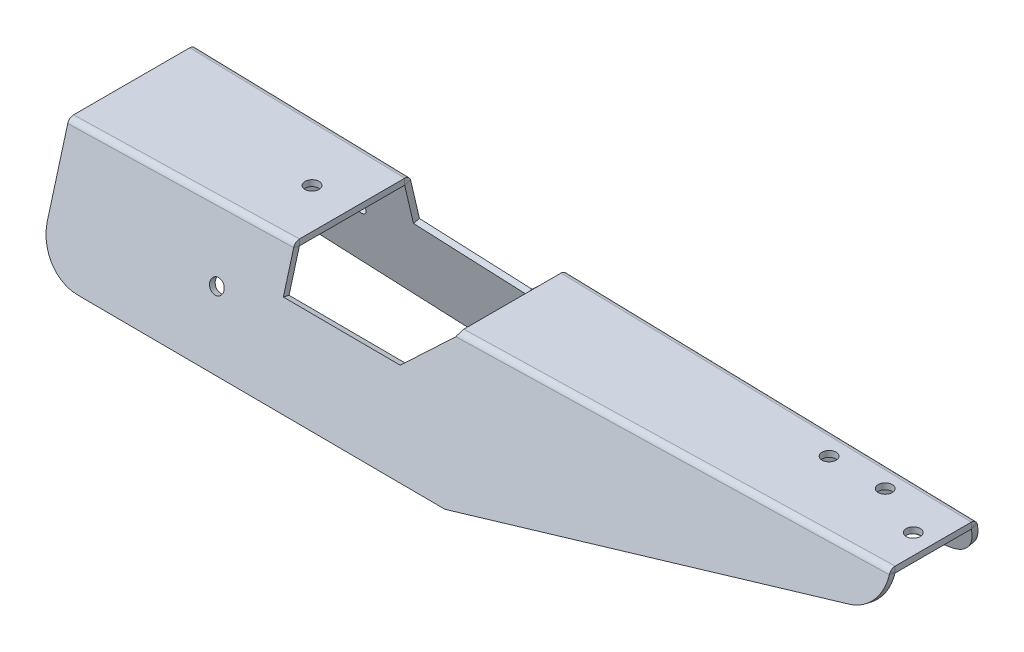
ISO-10303-21;
HEADER;
FILE_DESCRIPTION(('STEP AP214'),'2;1');
FILE_NAME('part.step','',(''),(''),'','','');
FILE_SCHEMA(('AUTOMOTIVE_DESIGN { 1 0 10303 214 1 1 1 1 }'));
ENDSEC;
DATA;
#1=APPLICATION_CONTEXT('core data for automotive mechanical design processes');
#2=APPLICATION_PROTOCOL_DEFINITION('international standard','automotive_design',2000,#1);
#3=PRODUCT_CONTEXT('',#1,'mechanical');
#4=PRODUCT('Part','Part','',(#3));
#5=PRODUCT_RELATED_PRODUCT_CATEGORY('part','',(#4));
#6=PRODUCT_DEFINITION_FORMATION('','',#4);
#7=PRODUCT_DEFINITION_CONTEXT('part definition',#1,'design');
#8=PRODUCT_DEFINITION('design','',#6,#7);
#9=PRODUCT_DEFINITION_SHAPE('','',#8);
#10=(LENGTH_UNIT() NAMED_UNIT(*) SI_UNIT(.MILLI.,.METRE.));
#11=(NAMED_UNIT(*) PLANE_ANGLE_UNIT() SI_UNIT($,.RADIAN.));
#12=(NAMED_UNIT(*) SI_UNIT($,.STERADIAN.) SOLID_ANGLE_UNIT());
#13=UNCERTAINTY_MEASURE_WITH_UNIT(LENGTH_MEASURE(1.E-05),#10,'distance_accuracy_value','');
#14=(GEOMETRIC_REPRESENTATION_CONTEXT(3) GLOBAL_UNCERTAINTY_ASSIGNED_CONTEXT((#13)) GLOBAL_UNIT_ASSIGNED_CONTEXT((#10,
#11,#12)) REPRESENTATION_CONTEXT('',''));
#15=CARTESIAN_POINT('',(0.,0.,0.));
#16=DIRECTION('',(0.,0.,1.));
#17=DIRECTION('',(1.,0.,0.));
#18=AXIS2_PLACEMENT_3D('',#15,#16,#17);
#19=CARTESIAN_POINT('',(16.6574629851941,1.5,-12.6252174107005));
#20=DIRECTION('',(-1.,0.,0.));
#21=DIRECTION('',(0.,0.,1.));
#22=AXIS2_PLACEMENT_3D('',#19,#20,#21);
#23=PLANE('',#22);
#24=DIRECTION('',(0.,0.,-1.));
#25=VECTOR('',#24,1.);
#26=CARTESIAN_POINT('',(16.6574629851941,1.5,-12.6252174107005));
#27=LINE('',#26,#25);
#28=CARTESIAN_POINT('',(16.6574629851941,1.5,12.1207914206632));
#29=VERTEX_POINT('',#28);
#30=CARTESIAN_POINT('',(16.6574629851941,1.50000000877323,-12.1207914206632));
#31=VERTEX_POINT('',#30);
#32=EDGE_CURVE('E803',#29,#31,#27,.T.);
#33=ORIENTED_EDGE('',*,*,#32,.T.);
#34=CARTESIAN_POINT('',(16.657462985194,8.77323127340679E-09,-12.1207914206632));
#35=CARTESIAN_POINT('',(16.657462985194,1.50000000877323,-12.1207914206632));
#36=B_SPLINE_CURVE_WITH_KNOTS('',1,(#34,#35),.UNSPECIFIED.,.F.,.F.,(2,2),(0.,1.),.UNSPECIFIED.);
#37=CARTESIAN_POINT('',(16.6574629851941,0.,-12.1207914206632));
#38=VERTEX_POINT('',#37);
#39=EDGE_CURVE('E756',#31,#38,#36,.F.);
#40=ORIENTED_EDGE('',*,*,#39,.T.);
#41=DIRECTION('',(0.,0.,-1.));
#42=VECTOR('',#41,1.);
#43=CARTESIAN_POINT('',(16.6574629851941,0.,-12.6252174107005));
#44=LINE('',#43,#42);
#45=CARTESIAN_POINT('',(16.6574629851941,0.,12.1207914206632));
#46=VERTEX_POINT('',#45);
#47=EDGE_CURVE('E804',#46,#38,#44,.T.);
#48=ORIENTED_EDGE('',*,*,#47,.F.);
#49=CARTESIAN_POINT('',(16.6574629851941,1.50000000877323,12.1207914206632));
#50=CARTESIAN_POINT('',(16.6574629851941,8.77323127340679E-09,12.1207914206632));
#51=B_SPLINE_CURVE_WITH_KNOTS('',1,(#49,#50),.UNSPECIFIED.,.F.,.F.,(2,2),(0.,1.),.UNSPECIFIED.);
#52=EDGE_CURVE('E849',#46,#29,#51,.F.);
#53=ORIENTED_EDGE('',*,*,#52,.T.);
#54=EDGE_LOOP('',(#33,#40,#48,#53));
#55=FACE_BOUND('',#54,.T.);
#56=ADVANCED_FACE('F114',(#55),#23,.T.);
#57=CARTESIAN_POINT('',(111.657521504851,1.5,-10.2502159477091));
#58=DIRECTION('',(0.,1.,0.));
#59=DIRECTION('',(0.,0.,1.));
#60=AXIS2_PLACEMENT_3D('',#57,#58,#59);
#61=PLANE('',#60);
#62=CARTESIAN_POINT('',(-33.3425370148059,1.5,0.));
#63=DIRECTION('',(0.,1.,0.));
#64=DIRECTION('',(0.,0.,1.));
#65=AXIS2_PLACEMENT_3D('',#62,#63,#64);
#66=CIRCLE('',#65,1.75);
#67=CARTESIAN_POINT('',(-33.3425370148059,1.5,1.75));
#68=VERTEX_POINT('',#67);
#69=EDGE_CURVE('E1243',#68,#68,#66,.T.);
#70=ORIENTED_EDGE('',*,*,#69,.F.);
#71=EDGE_LOOP('',(#70));
#72=FACE_BOUND('',#71,.T.);
#73=DIRECTION('',(0.,0.,1.));
#74=VECTOR('',#73,1.);
#75=CARTESIAN_POINT('',(-23.3425370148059,1.5,24.));
#76=LINE('',#75,#74);
#77=CARTESIAN_POINT('',(-23.3425370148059,1.5,-13.1207914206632));
#78=VERTEX_POINT('',#77);
#79=CARTESIAN_POINT('',(-23.342537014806,1.50000000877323,13.1207914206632));
#80=VERTEX_POINT('',#79);
#81=EDGE_CURVE('E795',#78,#80,#76,.T.);
#82=ORIENTED_EDGE('',*,*,#81,.F.);
#83=DIRECTION('',(-0.999687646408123,0.,-0.024992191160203));
#84=VECTOR('',#83,1.);
#85=CARTESIAN_POINT('',(111.644918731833,1.5,-9.74610502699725));
#86=LINE('',#85,#84);
#87=CARTESIAN_POINT('',(-78.342537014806,1.50000000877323,-14.4957914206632));
#88=VERTEX_POINT('',#87);
#89=EDGE_CURVE('E748',#78,#88,#86,.T.);
#90=ORIENTED_EDGE('',*,*,#89,.T.);
#91=DIRECTION('',(0.,0.,1.));
#92=VECTOR('',#91,1.);
#93=CARTESIAN_POINT('',(-78.3425370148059,1.5,34.9999999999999));
#94=LINE('',#93,#92);
#95=CARTESIAN_POINT('',(-78.3425370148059,1.50000000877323,14.4957914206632));
#96=VERTEX_POINT('',#95);
#97=EDGE_CURVE('E816',#88,#96,#94,.T.);
#98=ORIENTED_EDGE('',*,*,#97,.T.);
#99=DIRECTION('',(0.999687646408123,0.,-0.0249921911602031));
#100=VECTOR('',#99,1.);
#101=CARTESIAN_POINT('',(112.157109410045,1.5,9.73330026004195));
#102=LINE('',#101,#100);
#103=EDGE_CURVE('E805',#96,#80,#102,.T.);
#104=ORIENTED_EDGE('',*,*,#103,.T.);
#105=EDGE_LOOP('',(#82,#90,#98,#104));
#106=FACE_BOUND('',#105,.T.);
#107=ADVANCED_FACE('F700',(#72,#106),#61,.T.);
#108=CARTESIAN_POINT('',(103.657462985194,1.5,-6.));
#109=DIRECTION('',(0.,1.,0.));
#110=DIRECTION('',(0.,0.,1.));
#111=AXIS2_PLACEMENT_3D('',#108,#109,#110);
#112=CIRCLE('',#111,1.75);
#113=CARTESIAN_POINT('',(103.657462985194,1.5,-4.25));
#114=VERTEX_POINT('',#113);
#115=EDGE_CURVE('E1231',#114,#114,#112,.T.);
#116=ORIENTED_EDGE('',*,*,#115,.F.);
#117=EDGE_LOOP('',(#116));
#118=FACE_BOUND('',#117,.T.);
#119=CARTESIAN_POINT('',(116.657462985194,1.5,0.));
#120=DIRECTION('',(0.,1.,0.));
#121=DIRECTION('',(0.,0.,1.));
#122=AXIS2_PLACEMENT_3D('',#119,#120,#121);
#123=CIRCLE('',#122,1.75);
#124=CARTESIAN_POINT('',(116.657462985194,1.5,1.75));
#125=VERTEX_POINT('',#124);
#126=EDGE_CURVE('E1237',#125,#125,#123,.T.);
#127=ORIENTED_EDGE('',*,*,#126,.F.);
#128=EDGE_LOOP('',(#127));
#129=FACE_BOUND('',#128,.T.);
#130=CARTESIAN_POINT('',(89.6574629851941,1.5,-6.));
#131=DIRECTION('',(0.,1.,0.));
#132=DIRECTION('',(0.,0.,1.));
#133=AXIS2_PLACEMENT_3D('',#130,#131,#132);
#134=CIRCLE('',#133,1.75);
#135=CARTESIAN_POINT('',(89.6574629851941,1.5,-4.25));
#136=VERTEX_POINT('',#135);
#137=EDGE_CURVE('E1216',#136,#136,#134,.T.);
#138=ORIENTED_EDGE('',*,*,#137,.F.);
#139=EDGE_LOOP('',(#138));
#140=FACE_BOUND('',#139,.T.);
#141=DIRECTION('',(0.,0.,-1.));
#142=VECTOR('',#141,1.);
#143=CARTESIAN_POINT('',(121.657462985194,1.5,-10.2160049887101));
#144=LINE('',#143,#142);
#145=CARTESIAN_POINT('',(121.657462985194,1.50000000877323,9.49579142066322));
#146=VERTEX_POINT('',#145);
#147=CARTESIAN_POINT('',(121.657462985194,1.50000000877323,-9.49579142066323));
#148=VERTEX_POINT('',#147);
#149=EDGE_CURVE('E819',#146,#148,#144,.T.);
#150=ORIENTED_EDGE('',*,*,#149,.T.);
#151=DIRECTION('',(-0.999687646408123,0.,-0.024992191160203));
#152=VECTOR('',#151,1.);
#153=CARTESIAN_POINT('',(111.644918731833,1.5,-9.74610502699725));
#154=LINE('',#153,#152);
#155=EDGE_CURVE('E729',#148,#31,#154,.T.);
#156=ORIENTED_EDGE('',*,*,#155,.T.);
#157=ORIENTED_EDGE('',*,*,#32,.F.);
#158=DIRECTION('',(0.999687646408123,0.,-0.0249921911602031));
#159=VECTOR('',#158,1.);
#160=CARTESIAN_POINT('',(112.157109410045,1.5,9.73330026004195));
#161=LINE('',#160,#159);
#162=EDGE_CURVE('E858',#29,#146,#161,.T.);
#163=ORIENTED_EDGE('',*,*,#162,.T.);
#164=EDGE_LOOP('',(#150,#156,#157,#163));
#165=FACE_BOUND('',#164,.T.);
#166=ADVANCED_FACE('F706',(#118,#129,#140,#165),#61,.T.);
#167=CARTESIAN_POINT('',(-23.3425370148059,1.5,24.));
#168=DIRECTION('',(1.,0.,0.));
#169=DIRECTION('',(0.,0.,-1.));
#170=AXIS2_PLACEMENT_3D('',#167,#168,#169);
#171=PLANE('',#170);
#172=DIRECTION('',(0.,0.,1.));
#173=VECTOR('',#172,1.);
#174=CARTESIAN_POINT('',(-23.3425370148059,0.,24.));
#175=LINE('',#174,#173);
#176=CARTESIAN_POINT('',(-23.3425370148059,0.,-13.1207914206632));
#177=VERTEX_POINT('',#176);
#178=CARTESIAN_POINT('',(-23.3425370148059,0.,13.1207914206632));
#179=VERTEX_POINT('',#178);
#180=EDGE_CURVE('E141',#177,#179,#175,.T.);
#181=ORIENTED_EDGE('',*,*,#180,.F.);
#182=CARTESIAN_POINT('',(-23.342537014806,1.50000000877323,-13.1207914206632));
#183=CARTESIAN_POINT('',(-23.342537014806,8.77323127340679E-09,-13.1207914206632));
#184=B_SPLINE_CURVE_WITH_KNOTS('',1,(#182,#183),.UNSPECIFIED.,.F.,.F.,(2,2),(0.,1.),.UNSPECIFIED.);
#185=EDGE_CURVE('E568',#177,#78,#184,.F.);
#186=ORIENTED_EDGE('',*,*,#185,.T.);
#187=ORIENTED_EDGE('',*,*,#81,.T.);
#188=CARTESIAN_POINT('',(-23.3425370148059,8.77323127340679E-09,13.1207914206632));
#189=CARTESIAN_POINT('',(-23.3425370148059,1.50000000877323,13.1207914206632));
#190=B_SPLINE_CURVE_WITH_KNOTS('',1,(#188,#189),.UNSPECIFIED.,.F.,.F.,(2,2),(0.,1.),.UNSPECIFIED.);
#191=EDGE_CURVE('E875',#80,#179,#190,.F.);
#192=ORIENTED_EDGE('',*,*,#191,.T.);
#193=EDGE_LOOP('',(#181,#186,#187,#192));
#194=FACE_BOUND('',#193,.T.);
#195=ADVANCED_FACE('F778',(#194),#171,.T.);
#196=CARTESIAN_POINT('',(111.657521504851,0.,-10.2502159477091));
#197=DIRECTION('',(0.,1.,0.));
#198=DIRECTION('',(0.,0.,1.));
#199=AXIS2_PLACEMENT_3D('',#196,#197,#198);
#200=PLANE('',#199);
#201=DIRECTION('',(-0.999687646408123,0.,-0.024992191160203));
#202=VECTOR('',#201,1.);
#203=CARTESIAN_POINT('',(111.644918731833,0.,-9.74610502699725));
#204=LINE('',#203,#202);
#205=CARTESIAN_POINT('',(121.657462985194,8.77323127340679E-09,-9.49579142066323));
#206=VERTEX_POINT('',#205);
#207=EDGE_CURVE('E814',#206,#38,#204,.T.);
#208=ORIENTED_EDGE('',*,*,#207,.F.);
#209=DIRECTION('',(0.,0.,-1.));
#210=VECTOR('',#209,1.);
#211=CARTESIAN_POINT('',(121.657462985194,0.,-10.2160049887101));
#212=LINE('',#211,#210);
#213=CARTESIAN_POINT('',(121.657462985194,0.,9.49579142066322));
#214=VERTEX_POINT('',#213);
#215=EDGE_CURVE('E820',#214,#206,#212,.T.);
#216=ORIENTED_EDGE('',*,*,#215,.F.);
#217=DIRECTION('',(0.999687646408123,0.,-0.0249921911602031));
#218=VECTOR('',#217,1.);
#219=CARTESIAN_POINT('',(112.157109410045,0.,9.73330026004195));
#220=LINE('',#219,#218);
#221=EDGE_CURVE('E857',#46,#214,#220,.T.);
#222=ORIENTED_EDGE('',*,*,#221,.F.);
#223=ORIENTED_EDGE('',*,*,#47,.T.);
#224=EDGE_LOOP('',(#208,#216,#222,#223));
#225=FACE_BOUND('',#224,.T.);
#226=CARTESIAN_POINT('',(103.657462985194,0.,-6.));
#227=DIRECTION('',(0.,1.,0.));
#228=DIRECTION('',(0.,0.,1.));
#229=AXIS2_PLACEMENT_3D('',#226,#227,#228);
#230=CIRCLE('',#229,1.75);
#231=CARTESIAN_POINT('',(103.657462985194,0.,-4.25));
#232=VERTEX_POINT('',#231);
#233=EDGE_CURVE('E1221',#232,#232,#230,.T.);
#234=ORIENTED_EDGE('',*,*,#233,.T.);
#235=EDGE_LOOP('',(#234));
#236=FACE_BOUND('',#235,.T.);
#237=CARTESIAN_POINT('',(116.657462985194,0.,0.));
#238=DIRECTION('',(0.,1.,0.));
#239=DIRECTION('',(0.,0.,1.));
#240=AXIS2_PLACEMENT_3D('',#237,#238,#239);
#241=CIRCLE('',#240,1.75);
#242=CARTESIAN_POINT('',(116.657462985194,0.,1.75));
#243=VERTEX_POINT('',#242);
#244=EDGE_CURVE('E1234',#243,#243,#241,.T.);
#245=ORIENTED_EDGE('',*,*,#244,.T.);
#246=EDGE_LOOP('',(#245));
#247=FACE_BOUND('',#246,.T.);
#248=CARTESIAN_POINT('',(89.6574629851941,0.,-6.));
#249=DIRECTION('',(0.,1.,0.));
#250=DIRECTION('',(0.,0.,1.));
#251=AXIS2_PLACEMENT_3D('',#248,#249,#250);
#252=CIRCLE('',#251,1.75);
#253=CARTESIAN_POINT('',(89.6574629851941,0.,-4.25));
#254=VERTEX_POINT('',#253);
#255=EDGE_CURVE('E1211',#254,#254,#252,.T.);
#256=ORIENTED_EDGE('',*,*,#255,.T.);
#257=EDGE_LOOP('',(#256));
#258=FACE_BOUND('',#257,.T.);
#259=ADVANCED_FACE('F786',(#225,#236,#247,#258),#200,.F.);
#260=DIRECTION('',(-0.999687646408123,0.,-0.024992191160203));
#261=VECTOR('',#260,1.);
#262=CARTESIAN_POINT('',(111.644918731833,0.,-9.74610502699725));
#263=LINE('',#262,#261);
#264=CARTESIAN_POINT('',(-78.3425370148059,0.,-14.4957914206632));
#265=VERTEX_POINT('',#264);
#266=EDGE_CURVE('E126',#177,#265,#263,.T.);
#267=ORIENTED_EDGE('',*,*,#266,.F.);
#268=ORIENTED_EDGE('',*,*,#180,.T.);
#269=DIRECTION('',(0.999687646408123,0.,-0.0249921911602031));
#270=VECTOR('',#269,1.);
#271=CARTESIAN_POINT('',(112.157109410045,0.,9.73330026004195));
#272=LINE('',#271,#270);
#273=CARTESIAN_POINT('',(-78.3425370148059,8.77323127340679E-09,14.4957914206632));
#274=VERTEX_POINT('',#273);
#275=EDGE_CURVE('E1246',#274,#179,#272,.T.);
#276=ORIENTED_EDGE('',*,*,#275,.F.);
#277=DIRECTION('',(0.,0.,1.));
#278=VECTOR('',#277,1.);
#279=CARTESIAN_POINT('',(-78.3425370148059,0.,34.9999999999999));
#280=LINE('',#279,#278);
#281=EDGE_CURVE('E133',#265,#274,#280,.T.);
#282=ORIENTED_EDGE('',*,*,#281,.F.);
#283=EDGE_LOOP('',(#267,#268,#276,#282));
#284=FACE_BOUND('',#283,.T.);
#285=CARTESIAN_POINT('',(-33.3425370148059,0.,0.));
#286=DIRECTION('',(0.,1.,0.));
#287=DIRECTION('',(0.,0.,1.));
#288=AXIS2_PLACEMENT_3D('',#285,#286,#287);
#289=CIRCLE('',#288,1.75);
#290=CARTESIAN_POINT('',(-33.3425370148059,0.,1.75));
#291=VERTEX_POINT('',#290);
#292=EDGE_CURVE('E1240',#291,#291,#289,.T.);
#293=ORIENTED_EDGE('',*,*,#292,.T.);
#294=EDGE_LOOP('',(#293));
#295=FACE_BOUND('',#294,.T.);
#296=ADVANCED_FACE('F787',(#284,#295),#200,.F.);
#297=CARTESIAN_POINT('',(-78.3425370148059,1.5,34.9999999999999));
#298=DIRECTION('',(1.,0.,0.));
#299=DIRECTION('',(0.,0.,-1.));
#300=AXIS2_PLACEMENT_3D('',#297,#298,#299);
#301=PLANE('',#300);
#302=CARTESIAN_POINT('',(-78.342537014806,8.77323127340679E-09,-14.4957914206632));
#303=CARTESIAN_POINT('',(-78.342537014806,1.50000000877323,-14.4957914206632));
#304=B_SPLINE_CURVE_WITH_KNOTS('',1,(#302,#303),.UNSPECIFIED.,.F.,.F.,(2,2),(0.,1.),.UNSPECIFIED.);
#305=EDGE_CURVE('E12',#265,#88,#304,.T.);
#306=ORIENTED_EDGE('',*,*,#305,.F.);
#307=ORIENTED_EDGE('',*,*,#281,.T.);
#308=CARTESIAN_POINT('',(-78.3425370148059,1.50000000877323,14.4957914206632));
#309=CARTESIAN_POINT('',(-78.3425370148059,8.77323127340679E-09,14.4957914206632));
#310=B_SPLINE_CURVE_WITH_KNOTS('',1,(#308,#309),.UNSPECIFIED.,.F.,.F.,(2,2),(0.,1.),.UNSPECIFIED.);
#311=EDGE_CURVE('E824',#96,#274,#310,.T.);
#312=ORIENTED_EDGE('',*,*,#311,.F.);
#313=ORIENTED_EDGE('',*,*,#97,.F.);
#314=EDGE_LOOP('',(#306,#307,#312,#313));
#315=FACE_BOUND('',#314,.T.);
#316=ADVANCED_FACE('F116',(#315),#301,.F.);
#317=CARTESIAN_POINT('',(121.657462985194,1.5,-10.2160049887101));
#318=DIRECTION('',(-1.,0.,0.));
#319=DIRECTION('',(0.,0.,1.));
#320=AXIS2_PLACEMENT_3D('',#317,#318,#319);
#321=PLANE('',#320);
#322=CARTESIAN_POINT('',(121.657462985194,1.50000000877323,-9.49579142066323));
#323=CARTESIAN_POINT('',(121.657462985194,8.77323127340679E-09,-9.49579142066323));
#324=B_SPLINE_CURVE_WITH_KNOTS('',1,(#322,#323),.UNSPECIFIED.,.F.,.F.,(2,2),(0.,1.),.UNSPECIFIED.);
#325=EDGE_CURVE('E737',#148,#206,#324,.T.);
#326=ORIENTED_EDGE('',*,*,#325,.F.);
#327=ORIENTED_EDGE('',*,*,#149,.F.);
#328=CARTESIAN_POINT('',(121.657462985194,8.77323127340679E-09,9.49579142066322));
#329=CARTESIAN_POINT('',(121.657462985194,1.50000000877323,9.49579142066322));
#330=B_SPLINE_CURVE_WITH_KNOTS('',1,(#328,#329),.UNSPECIFIED.,.F.,.F.,(2,2),(0.,1.),.UNSPECIFIED.);
#331=EDGE_CURVE('E738',#214,#146,#330,.T.);
#332=ORIENTED_EDGE('',*,*,#331,.F.);
#333=ORIENTED_EDGE('',*,*,#215,.T.);
#334=EDGE_LOOP('',(#326,#327,#332,#333));
#335=FACE_BOUND('',#334,.T.);
#336=ADVANCED_FACE('F712',(#335),#321,.F.);
#337=CARTESIAN_POINT('',(-33.3425370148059,1.5,0.));
#338=DIRECTION('',(0.,-1.,0.));
#339=DIRECTION('',(0.,0.,-1.));
#340=AXIS2_PLACEMENT_3D('',#337,#338,#339);
#341=CYLINDRICAL_SURFACE('',#340,1.75);
#342=ORIENTED_EDGE('',*,*,#69,.T.);
#343=EDGE_LOOP('',(#342));
#344=FACE_BOUND('',#343,.T.);
#345=ORIENTED_EDGE('',*,*,#292,.F.);
#346=EDGE_LOOP('',(#345));
#347=FACE_BOUND('',#346,.T.);
#348=ADVANCED_FACE('F1320',(#344,#347),#341,.F.);
#349=CARTESIAN_POINT('',(116.657462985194,1.5,0.));
#350=DIRECTION('',(0.,-1.,0.));
#351=DIRECTION('',(0.,0.,-1.));
#352=AXIS2_PLACEMENT_3D('',#349,#350,#351);
#353=CYLINDRICAL_SURFACE('',#352,1.75);
#354=ORIENTED_EDGE('',*,*,#126,.T.);
#355=EDGE_LOOP('',(#354));
#356=FACE_BOUND('',#355,.T.);
#357=ORIENTED_EDGE('',*,*,#244,.F.);
#358=EDGE_LOOP('',(#357));
#359=FACE_BOUND('',#358,.T.);
#360=ADVANCED_FACE('F1333',(#356,#359),#353,.F.);
#361=CARTESIAN_POINT('',(103.657462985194,1.5,-6.));
#362=DIRECTION('',(0.,-1.,0.));
#363=DIRECTION('',(0.,0.,-1.));
#364=AXIS2_PLACEMENT_3D('',#361,#362,#363);
#365=CYLINDRICAL_SURFACE('',#364,1.75);
#366=ORIENTED_EDGE('',*,*,#115,.T.);
#367=EDGE_LOOP('',(#366));
#368=FACE_BOUND('',#367,.T.);
#369=ORIENTED_EDGE('',*,*,#233,.F.);
#370=EDGE_LOOP('',(#369));
#371=FACE_BOUND('',#370,.T.);
#372=ADVANCED_FACE('F1335',(#368,#371),#365,.F.);
#373=CARTESIAN_POINT('',(89.6574629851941,1.5,-6.));
#374=DIRECTION('',(0.,-1.,0.));
#375=DIRECTION('',(0.,0.,-1.));
#376=AXIS2_PLACEMENT_3D('',#373,#374,#375);
#377=CYLINDRICAL_SURFACE('',#376,1.75);
#378=ORIENTED_EDGE('',*,*,#137,.T.);
#379=EDGE_LOOP('',(#378));
#380=FACE_BOUND('',#379,.T.);
#381=ORIENTED_EDGE('',*,*,#255,.F.);
#382=EDGE_LOOP('',(#381));
#383=FACE_BOUND('',#382,.T.);
#384=ADVANCED_FACE('F1278',(#380,#383),#377,.F.);
#385=CARTESIAN_POINT('',(-78.3425370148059,1.50000000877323,14.4957914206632));
#386=CARTESIAN_POINT('',(-78.33838717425,1.50000000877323,14.8300970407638));
#387=CARTESIAN_POINT('',(-78.3342756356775,1.38541839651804,15.1623856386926));
#388=CARTESIAN_POINT('',(-78.3295251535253,0.974374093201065,15.6885439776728));
#389=CARTESIAN_POINT('',(-78.3289305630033,0.679676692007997,15.8801546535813));
#390=CARTESIAN_POINT('',(-78.3311144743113,0.355302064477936,15.9611101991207));
#391=CARTESIAN_POINT('',(-78.3425370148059,8.77323127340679E-09,14.4957914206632));
#392=CARTESIAN_POINT('',(-78.3466821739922,8.77323165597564E-09,14.4981071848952));
#393=CARTESIAN_POINT('',(-78.3508249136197,-0.00075881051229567,14.5004145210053));
#394=CARTESIAN_POINT('',(-78.359136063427,-0.00348096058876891,14.5041075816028));
#395=CARTESIAN_POINT('',(-78.3633021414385,-0.00543502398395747,14.505481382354));
#396=CARTESIAN_POINT('',(-78.3674891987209,-0.00758077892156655,14.5061212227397));
#397=B_SPLINE_SURFACE_WITH_KNOTS('',1,3,((#385,#386,#387,#388,#389,#390),(#391,#392,#393,#394,
#395,#396)),.UNSPECIFIED.,.F.,.F.,.F.,(2,2),(4,2,4),(0.,1.),(0.,0.5,1.),.UNSPECIFIED.);
#398=CARTESIAN_POINT('',(-78.3425370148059,8.77323127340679E-09,14.4957914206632));
#399=CARTESIAN_POINT('',(-78.3466821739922,8.77323165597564E-09,14.4981071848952));
#400=CARTESIAN_POINT('',(-78.3508249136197,-0.00075881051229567,14.5004145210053));
#401=CARTESIAN_POINT('',(-78.359136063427,-0.00348096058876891,14.5041075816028));
#402=CARTESIAN_POINT('',(-78.3633021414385,-0.00543502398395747,14.505481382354));
#403=CARTESIAN_POINT('',(-78.3674891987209,-0.00758077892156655,14.5061212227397));
#404=B_SPLINE_CURVE_WITH_KNOTS('',3,(#398,#399,#400,#401,#402,#403),.UNSPECIFIED.,.F.,.F.,(4,2,
4),(0.,0.5,1.),.UNSPECIFIED.);
#405=CARTESIAN_POINT('',(-78.3674891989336,-0.00758078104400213,14.5061212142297));
#406=VERTEX_POINT('',#405);
#407=EDGE_CURVE('E1189',#274,#406,#404,.T.);
#408=CARTESIAN_POINT('',(-78.3674891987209,-0.00758077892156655,14.5061212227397));
#409=CARTESIAN_POINT('',(-78.3311144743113,0.355302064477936,15.9611101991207));
#410=B_SPLINE_CURVE_WITH_KNOTS('',1,(#408,#409),.UNSPECIFIED.,.F.,.F.,(2,2),(0.,1.),.UNSPECIFIED.);
#411=CARTESIAN_POINT('',(-78.3311144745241,0.355302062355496,15.9611101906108));
#412=VERTEX_POINT('',#411);
#413=EDGE_CURVE('E1082',#412,#406,#410,.F.);
#414=CARTESIAN_POINT('',(-78.3311144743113,0.355302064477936,15.9611101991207));
#415=CARTESIAN_POINT('',(-78.3289305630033,0.679676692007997,15.8801546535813));
#416=CARTESIAN_POINT('',(-78.3295251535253,0.974374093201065,15.6885439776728));
#417=CARTESIAN_POINT('',(-78.3342756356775,1.38541839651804,15.1623856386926));
#418=CARTESIAN_POINT('',(-78.33838717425,1.50000000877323,14.8300970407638));
#419=CARTESIAN_POINT('',(-78.3425370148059,1.50000000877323,14.4957914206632));
#420=B_SPLINE_CURVE_WITH_KNOTS('',3,(#414,#415,#416,#417,#418,#419),.UNSPECIFIED.,.F.,.F.,(4,2,
4),(0.,0.5,1.),.UNSPECIFIED.);
#421=EDGE_CURVE('E1196',#96,#412,#420,.F.);
#422=ORIENTED_EDGE('',*,*,#311,.T.);
#423=ORIENTED_EDGE('',*,*,#407,.T.);
#424=ORIENTED_EDGE('',*,*,#413,.F.);
#425=ORIENTED_EDGE('',*,*,#421,.F.);
#426=EDGE_LOOP('',(#422,#423,#424,#425));
#427=FACE_BOUND('',#426,.T.);
#428=ADVANCED_FACE('F1273',(#427),#397,.T.);
#429=CARTESIAN_POINT('',(-23.3311144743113,0.355302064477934,14.5861101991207));
#430=CARTESIAN_POINT('',(-23.3289305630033,0.679676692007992,14.5051546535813));
#431=CARTESIAN_POINT('',(-23.3295251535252,0.97437409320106,14.3135439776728));
#432=CARTESIAN_POINT('',(-23.3342756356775,1.38541839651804,13.7873856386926));
#433=CARTESIAN_POINT('',(-23.33838717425,1.50000000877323,13.4550970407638));
#434=CARTESIAN_POINT('',(-23.3425370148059,1.50000000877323,13.1207914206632));
#435=CARTESIAN_POINT('',(-23.3674891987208,-0.00758077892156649,13.1311212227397));
#436=CARTESIAN_POINT('',(-23.3633021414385,-0.00543502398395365,13.130481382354));
#437=CARTESIAN_POINT('',(-23.359136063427,-0.00348096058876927,13.1291075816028));
#438=CARTESIAN_POINT('',(-23.3508249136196,-0.000758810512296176,13.1254145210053));
#439=CARTESIAN_POINT('',(-23.3466821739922,8.77323126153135E-09,13.1231071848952));
#440=CARTESIAN_POINT('',(-23.3425370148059,8.77323127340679E-09,13.1207914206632));
#441=B_SPLINE_SURFACE_WITH_KNOTS('',1,3,((#429,#430,#431,#432,#433,#434),(#435,#436,#437,#438,
#439,#440)),.UNSPECIFIED.,.F.,.F.,.F.,(2,2),(4,2,4),(0.,1.),(0.,0.5,1.),.UNSPECIFIED.);
#442=CARTESIAN_POINT('',(-23.3674891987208,-0.00758077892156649,13.1311212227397));
#443=CARTESIAN_POINT('',(-23.3633021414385,-0.00543502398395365,13.130481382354));
#444=CARTESIAN_POINT('',(-23.359136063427,-0.00348096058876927,13.1291075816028));
#445=CARTESIAN_POINT('',(-23.3508249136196,-0.000758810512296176,13.1254145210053));
#446=CARTESIAN_POINT('',(-23.3466821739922,8.77323126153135E-09,13.1231071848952));
#447=CARTESIAN_POINT('',(-23.3425370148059,8.77323127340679E-09,13.1207914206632));
#448=B_SPLINE_CURVE_WITH_KNOTS('',3,(#442,#443,#444,#445,#446,#447),.UNSPECIFIED.,.F.,.F.,(4,2,
4),(0.,0.5,1.),.UNSPECIFIED.);
#449=CARTESIAN_POINT('',(-23.3674891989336,-0.00758078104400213,13.1311212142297));
#450=VERTEX_POINT('',#449);
#451=EDGE_CURVE('E1191',#450,#179,#448,.T.);
#452=CARTESIAN_POINT('',(-23.3425370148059,1.50000000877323,13.1207914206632));
#453=CARTESIAN_POINT('',(-23.33838717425,1.50000000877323,13.4550970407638));
#454=CARTESIAN_POINT('',(-23.3342756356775,1.38541839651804,13.7873856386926));
#455=CARTESIAN_POINT('',(-23.3295251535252,0.97437409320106,14.3135439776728));
#456=CARTESIAN_POINT('',(-23.3289305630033,0.679676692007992,14.5051546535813));
#457=CARTESIAN_POINT('',(-23.3311144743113,0.355302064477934,14.5861101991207));
#458=B_SPLINE_CURVE_WITH_KNOTS('',3,(#452,#453,#454,#455,#456,#457),.UNSPECIFIED.,.F.,.F.,(4,2,
4),(0.,0.5,1.),.UNSPECIFIED.);
#459=CARTESIAN_POINT('',(-23.3311144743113,0.355302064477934,14.5861101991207));
#460=VERTEX_POINT('',#459);
#461=EDGE_CURVE('E1203',#460,#80,#458,.F.);
#462=CARTESIAN_POINT('',(-23.3311144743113,0.355302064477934,14.5861101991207));
#463=CARTESIAN_POINT('',(-23.3674891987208,-0.00758077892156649,13.1311212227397));
#464=B_SPLINE_CURVE_WITH_KNOTS('',1,(#462,#463),.UNSPECIFIED.,.F.,.F.,(2,2),(0.,1.),.UNSPECIFIED.);
#465=EDGE_CURVE('E2011',#460,#450,#464,.T.);
#466=ORIENTED_EDGE('',*,*,#451,.T.);
#467=ORIENTED_EDGE('',*,*,#191,.F.);
#468=ORIENTED_EDGE('',*,*,#461,.F.);
#469=ORIENTED_EDGE('',*,*,#465,.T.);
#470=EDGE_LOOP('',(#466,#467,#468,#469));
#471=FACE_BOUND('',#470,.T.);
#472=ADVANCED_FACE('F1252',(#471),#441,.T.);
#473=CARTESIAN_POINT('',(-105.897384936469,-0.01,15.1846626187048));
#474=DIRECTION('',(0.999687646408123,0.,-0.0249921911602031));
#475=DIRECTION('',(-0.0249921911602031,0.,-0.999687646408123));
#476=AXIS2_PLACEMENT_3D('',#473,#474,#475);
#477=CYLINDRICAL_SURFACE('',#476,1.51000000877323);
#478=DIRECTION('',(0.999687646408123,0.,-0.0249921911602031));
#479=VECTOR('',#478,1.);
#480=CARTESIAN_POINT('',(112.193726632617,0.355302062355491,11.1979891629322));
#481=LINE('',#480,#479);
#482=EDGE_CURVE('E1351',#412,#460,#481,.T.);
#483=ORIENTED_EDGE('',*,*,#482,.T.);
#484=ORIENTED_EDGE('',*,*,#461,.T.);
#485=ORIENTED_EDGE('',*,*,#103,.F.);
#486=ORIENTED_EDGE('',*,*,#421,.T.);
#487=EDGE_LOOP('',(#483,#484,#485,#486));
#488=FACE_BOUND('',#487,.T.);
#489=ADVANCED_FACE('F1272',(#488),#477,.T.);
#490=CARTESIAN_POINT('',(-105.897384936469,-0.01,15.1846626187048));
#491=DIRECTION('',(0.999687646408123,0.,-0.0249921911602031));
#492=DIRECTION('',(-0.0249921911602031,0.,-0.999687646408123));
#493=AXIS2_PLACEMENT_3D('',#490,#491,#492);
#494=CYLINDRICAL_SURFACE('',#493,0.0100000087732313);
#495=DIRECTION('',(0.999687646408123,0.,-0.0249921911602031));
#496=VECTOR('',#495,1.);
#497=CARTESIAN_POINT('',(112.157351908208,-0.00758078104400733,9.74300018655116));
#498=LINE('',#497,#496);
#499=EDGE_CURVE('E1092',#406,#450,#498,.T.);
#500=ORIENTED_EDGE('',*,*,#499,.F.);
#501=ORIENTED_EDGE('',*,*,#407,.F.);
#502=ORIENTED_EDGE('',*,*,#275,.T.);
#503=ORIENTED_EDGE('',*,*,#451,.F.);
#504=EDGE_LOOP('',(#500,#501,#502,#503));
#505=FACE_BOUND('',#504,.T.);
#506=ADVANCED_FACE('F906',(#505),#494,.F.);
#507=CARTESIAN_POINT('',(16.6574629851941,1.50000000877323,12.1207914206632));
#508=CARTESIAN_POINT('',(16.6616233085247,1.50000000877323,12.4559415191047));
#509=CARTESIAN_POINT('',(16.6657194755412,1.38604442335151,12.7867398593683));
#510=CARTESIAN_POINT('',(16.6681026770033,1.17963033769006,13.0508050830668));
#511=CARTESIAN_POINT('',(16.6574629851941,8.77323127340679E-09,12.1207914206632));
#512=CARTESIAN_POINT('',(16.6533127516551,8.77323124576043E-09,12.1231100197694));
#513=CARTESIAN_POINT('',(16.6491761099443,-0.000757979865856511,12.1254144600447));
#514=CARTESIAN_POINT('',(16.6450141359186,-0.00212164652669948,12.1272634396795));
#515=B_SPLINE_SURFACE_WITH_KNOTS('',1,3,((#507,#508,#509,#510),(#511,#512,#513,#514)),
.UNSPECIFIED.,.F.,.F.,.F.,(2,2),(4,4),(0.,1.),(0.,1.),.UNSPECIFIED.);
#516=CARTESIAN_POINT('',(16.6574629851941,8.77323127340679E-09,12.1207914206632));
#517=CARTESIAN_POINT('',(16.6533127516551,8.77323124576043E-09,12.1231100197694));
#518=CARTESIAN_POINT('',(16.6491761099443,-0.000757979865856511,12.1254144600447));
#519=CARTESIAN_POINT('',(16.6450141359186,-0.00212164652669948,12.1272634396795));
#520=B_SPLINE_CURVE_WITH_KNOTS('',3,(#516,#517,#518,#519),.UNSPECIFIED.,.F.,.F.,(4,4),(0.,1.),.UNSPECIFIED.);
#521=CARTESIAN_POINT('',(16.6450141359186,-0.00212164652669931,12.1272634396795));
#522=VERTEX_POINT('',#521);
#523=EDGE_CURVE('E1059',#46,#522,#520,.T.);
#524=CARTESIAN_POINT('',(16.6450141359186,-0.00212164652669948,12.1272634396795));
#525=CARTESIAN_POINT('',(16.6681026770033,1.17963033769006,13.0508050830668));
#526=B_SPLINE_CURVE_WITH_KNOTS('',1,(#524,#525),.UNSPECIFIED.,.F.,.F.,(2,2),(0.,1.),.UNSPECIFIED.);
#527=CARTESIAN_POINT('',(16.6681026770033,1.17963033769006,13.0508050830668));
#528=VERTEX_POINT('',#527);
#529=EDGE_CURVE('E878',#522,#528,#526,.T.);
#530=CARTESIAN_POINT('',(16.6681026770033,1.17963033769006,13.0508050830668));
#531=CARTESIAN_POINT('',(16.6657194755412,1.38604442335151,12.7867398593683));
#532=CARTESIAN_POINT('',(16.6616233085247,1.50000000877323,12.4559415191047));
#533=CARTESIAN_POINT('',(16.6574629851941,1.50000000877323,12.1207914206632));
#534=B_SPLINE_CURVE_WITH_KNOTS('',3,(#530,#531,#532,#533),.UNSPECIFIED.,.F.,.F.,(4,4),(0.,1.),.UNSPECIFIED.);
#535=EDGE_CURVE('E866',#29,#528,#534,.F.);
#536=ORIENTED_EDGE('',*,*,#52,.F.);
#537=ORIENTED_EDGE('',*,*,#523,.T.);
#538=ORIENTED_EDGE('',*,*,#529,.T.);
#539=ORIENTED_EDGE('',*,*,#535,.F.);
#540=EDGE_LOOP('',(#536,#537,#538,#539));
#541=FACE_BOUND('',#540,.T.);
#542=ADVANCED_FACE('F877',(#541),#515,.T.);
#543=CARTESIAN_POINT('',(16.6681026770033,1.17963033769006,13.0508050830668));
#544=CARTESIAN_POINT('',(16.4976583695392,0.973501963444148,13.3188254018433));
#545=CARTESIAN_POINT('',(16.3269821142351,0.680045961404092,13.5136647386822));
#546=CARTESIAN_POINT('',(16.1519715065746,0.355302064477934,13.5990330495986));
#547=CARTESIAN_POINT('',(16.6450141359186,-0.00212164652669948,12.1272634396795));
#548=CARTESIAN_POINT('',(16.4685555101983,-0.00348263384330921,12.1334164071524));
#549=CARTESIAN_POINT('',(16.2920855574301,-0.00543661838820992,12.1390970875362));
#550=CARTESIAN_POINT('',(16.115596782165,-0.00758077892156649,12.1440440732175));
#551=B_SPLINE_SURFACE_WITH_KNOTS('',1,3,((#543,#544,#545,#546),(#547,#548,#549,#550)),
.UNSPECIFIED.,.F.,.F.,.F.,(2,2),(4,4),(0.,1.),(0.,1.),.UNSPECIFIED.);
#552=CARTESIAN_POINT('',(16.6450141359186,-0.00212164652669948,12.1272634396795));
#553=CARTESIAN_POINT('',(16.4685555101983,-0.00348263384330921,12.1334164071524));
#554=CARTESIAN_POINT('',(16.2920855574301,-0.00543661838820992,12.1390970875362));
#555=CARTESIAN_POINT('',(16.115596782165,-0.00758077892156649,12.1440440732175));
#556=B_SPLINE_CURVE_WITH_KNOTS('',3,(#552,#553,#554,#555),.UNSPECIFIED.,.F.,.F.,(4,4),(0.,1.),.UNSPECIFIED.);
#557=CARTESIAN_POINT('',(16.1155967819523,-0.00758078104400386,12.1440440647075));
#558=VERTEX_POINT('',#557);
#559=EDGE_CURVE('E1029',#522,#558,#556,.T.);
#560=CARTESIAN_POINT('',(16.115596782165,-0.00758077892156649,12.1440440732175));
#561=CARTESIAN_POINT('',(16.1519715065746,0.355302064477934,13.5990330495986));
#562=B_SPLINE_CURVE_WITH_KNOTS('',1,(#560,#561),.UNSPECIFIED.,.F.,.F.,(2,2),(0.,1.),.UNSPECIFIED.);
#563=CARTESIAN_POINT('',(16.1519715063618,0.355302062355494,13.5990330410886));
#564=VERTEX_POINT('',#563);
#565=EDGE_CURVE('E1020',#558,#564,#562,.T.);
#566=CARTESIAN_POINT('',(16.1519715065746,0.355302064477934,13.5990330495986));
#567=CARTESIAN_POINT('',(16.3269821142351,0.680045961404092,13.5136647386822));
#568=CARTESIAN_POINT('',(16.4976583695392,0.973501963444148,13.3188254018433));
#569=CARTESIAN_POINT('',(16.6681026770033,1.17963033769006,13.0508050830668));
#570=B_SPLINE_CURVE_WITH_KNOTS('',3,(#566,#567,#568,#569),.UNSPECIFIED.,.F.,.F.,(4,4),(0.,1.),.UNSPECIFIED.);
#571=EDGE_CURVE('E881',#528,#564,#570,.F.);
#572=ORIENTED_EDGE('',*,*,#529,.F.);
#573=ORIENTED_EDGE('',*,*,#559,.T.);
#574=ORIENTED_EDGE('',*,*,#565,.T.);
#575=ORIENTED_EDGE('',*,*,#571,.F.);
#576=EDGE_LOOP('',(#572,#573,#574,#575));
#577=FACE_BOUND('',#576,.T.);
#578=ADVANCED_FACE('F905',(#577),#551,.T.);
#579=CARTESIAN_POINT('',(121.665715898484,0.35530206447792,10.9611894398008));
#580=CARTESIAN_POINT('',(121.668020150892,0.540542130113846,10.9149318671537));
#581=CARTESIAN_POINT('',(121.669434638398,0.716593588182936,10.8332987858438));
#582=CARTESIAN_POINT('',(121.670107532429,0.871589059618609,10.7217868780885));
#583=CARTESIAN_POINT('',(121.629341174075,-0.00758077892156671,9.50620046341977));
#584=CARTESIAN_POINT('',(121.632790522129,-0.00635456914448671,9.50580840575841));
#585=CARTESIAN_POINT('',(121.636233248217,-0.00518766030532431,9.50518148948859));
#586=CARTESIAN_POINT('',(121.639671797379,-0.00416165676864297,9.5043574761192));
#587=B_SPLINE_SURFACE_WITH_KNOTS('',1,3,((#579,#580,#581,#582),(#583,#584,#585,#586)),
.UNSPECIFIED.,.F.,.F.,.F.,(2,2),(4,4),(0.,1.),(0.,1.),.UNSPECIFIED.);
#588=CARTESIAN_POINT('',(121.665715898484,0.35530206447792,10.9611894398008));
#589=CARTESIAN_POINT('',(121.629341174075,-0.00758077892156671,9.50620046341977));
#590=B_SPLINE_CURVE_WITH_KNOTS('',1,(#588,#589),.UNSPECIFIED.,.F.,.F.,(2,2),(0.,1.),.UNSPECIFIED.);
#591=CARTESIAN_POINT('',(121.629341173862,-0.00758078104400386,9.5062004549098));
#592=VERTEX_POINT('',#591);
#593=CARTESIAN_POINT('',(121.665715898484,0.35530206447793,10.9611894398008));
#594=VERTEX_POINT('',#593);
#595=EDGE_CURVE('E1083',#592,#594,#590,.F.);
#596=CARTESIAN_POINT('',(121.629341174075,-0.00758077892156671,9.50620046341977));
#597=CARTESIAN_POINT('',(121.632790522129,-0.00635456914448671,9.50580840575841));
#598=CARTESIAN_POINT('',(121.636233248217,-0.00518766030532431,9.50518148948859));
#599=CARTESIAN_POINT('',(121.639671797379,-0.00416165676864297,9.5043574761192));
#600=B_SPLINE_CURVE_WITH_KNOTS('',3,(#596,#597,#598,#599),.UNSPECIFIED.,.F.,.F.,(4,4),(0.,1.),.UNSPECIFIED.);
#601=CARTESIAN_POINT('',(121.639671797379,-0.00416165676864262,9.5043574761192));
#602=VERTEX_POINT('',#601);
#603=EDGE_CURVE('E1064',#592,#602,#600,.T.);
#604=CARTESIAN_POINT('',(121.639671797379,-0.00416165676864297,9.5043574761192));
#605=CARTESIAN_POINT('',(121.670107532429,0.871589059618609,10.7217868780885));
#606=B_SPLINE_CURVE_WITH_KNOTS('',1,(#604,#605),.UNSPECIFIED.,.F.,.F.,(2,2),(0.,1.),.UNSPECIFIED.);
#607=CARTESIAN_POINT('',(121.670107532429,0.871589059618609,10.7217868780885));
#608=VERTEX_POINT('',#607);
#609=EDGE_CURVE('E972',#602,#608,#606,.T.);
#610=CARTESIAN_POINT('',(121.670107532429,0.871589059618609,10.7217868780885));
#611=CARTESIAN_POINT('',(121.669434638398,0.716593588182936,10.8332987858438));
#612=CARTESIAN_POINT('',(121.668020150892,0.540542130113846,10.9149318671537));
#613=CARTESIAN_POINT('',(121.665715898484,0.35530206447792,10.9611894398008));
#614=B_SPLINE_CURVE_WITH_KNOTS('',3,(#610,#611,#612,#613),.UNSPECIFIED.,.F.,.F.,(4,4),(0.,1.),.UNSPECIFIED.);
#615=EDGE_CURVE('E1041',#594,#608,#614,.F.);
#616=ORIENTED_EDGE('',*,*,#595,.F.);
#617=ORIENTED_EDGE('',*,*,#603,.T.);
#618=ORIENTED_EDGE('',*,*,#609,.T.);
#619=ORIENTED_EDGE('',*,*,#615,.F.);
#620=EDGE_LOOP('',(#616,#617,#618,#619));
#621=FACE_BOUND('',#620,.T.);
#622=ADVANCED_FACE('F977',(#621),#587,.T.);
#623=CARTESIAN_POINT('',(121.670107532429,0.871589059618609,10.7217868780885));
#624=CARTESIAN_POINT('',(121.66962755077,1.06522722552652,10.5825063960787));
#625=CARTESIAN_POINT('',(121.667984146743,1.22498794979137,10.3967802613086));
#626=CARTESIAN_POINT('',(121.663377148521,1.44250140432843,9.9724291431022));
#627=CARTESIAN_POINT('',(121.660423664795,1.50000000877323,9.73429982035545));
#628=CARTESIAN_POINT('',(121.657462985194,1.50000000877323,9.49579142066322));
#629=CARTESIAN_POINT('',(121.639671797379,-0.00416165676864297,9.5043574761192));
#630=CARTESIAN_POINT('',(121.642648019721,-0.00287966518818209,9.50336087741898));
#631=CARTESIAN_POINT('',(121.645616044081,-0.00182126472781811,9.5020561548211));
#632=CARTESIAN_POINT('',(121.651543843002,-0.000380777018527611,9.49909692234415));
#633=CARTESIAN_POINT('',(121.654503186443,8.77323128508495E-09,9.49744496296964));
#634=CARTESIAN_POINT('',(121.657462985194,8.77323127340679E-09,9.49579142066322));
#635=B_SPLINE_SURFACE_WITH_KNOTS('',1,3,((#623,#624,#625,#626,#627,#628),(#629,#630,#631,#632,
#633,#634)),.UNSPECIFIED.,.F.,.F.,.F.,(2,2),(4,2,4),(0.,1.),(0.,0.5,1.),.UNSPECIFIED.);
#636=CARTESIAN_POINT('',(121.639671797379,-0.00416165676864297,9.5043574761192));
#637=CARTESIAN_POINT('',(121.642648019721,-0.00287966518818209,9.50336087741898));
#638=CARTESIAN_POINT('',(121.645616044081,-0.00182126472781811,9.5020561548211));
#639=CARTESIAN_POINT('',(121.651543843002,-0.000380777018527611,9.49909692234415));
#640=CARTESIAN_POINT('',(121.654503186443,8.77323128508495E-09,9.49744496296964));
#641=CARTESIAN_POINT('',(121.657462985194,8.77323127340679E-09,9.49579142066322));
#642=B_SPLINE_CURVE_WITH_KNOTS('',3,(#636,#637,#638,#639,#640,#641),.UNSPECIFIED.,.F.,.F.,(4,2,
4),(0.,0.5,1.),.UNSPECIFIED.);
#643=EDGE_CURVE('E882',#602,#214,#642,.T.);
#644=CARTESIAN_POINT('',(121.657462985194,1.50000000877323,9.49579142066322));
#645=CARTESIAN_POINT('',(121.660423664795,1.50000000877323,9.73429982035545));
#646=CARTESIAN_POINT('',(121.663377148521,1.44250140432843,9.9724291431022));
#647=CARTESIAN_POINT('',(121.667984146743,1.22498794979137,10.3967802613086));
#648=CARTESIAN_POINT('',(121.66962755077,1.06522722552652,10.5825063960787));
#649=CARTESIAN_POINT('',(121.670107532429,0.871589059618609,10.7217868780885));
#650=B_SPLINE_CURVE_WITH_KNOTS('',3,(#644,#645,#646,#647,#648,#649),.UNSPECIFIED.,.F.,.F.,(4,2,
4),(0.,0.5,1.),.UNSPECIFIED.);
#651=EDGE_CURVE('E870',#608,#146,#650,.F.);
#652=ORIENTED_EDGE('',*,*,#643,.T.);
#653=ORIENTED_EDGE('',*,*,#331,.T.);
#654=ORIENTED_EDGE('',*,*,#651,.F.);
#655=ORIENTED_EDGE('',*,*,#609,.F.);
#656=EDGE_LOOP('',(#652,#653,#654,#655));
#657=FACE_BOUND('',#656,.T.);
#658=ADVANCED_FACE('F911',(#657),#635,.T.);
#659=CARTESIAN_POINT('',(-36.4001671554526,-0.01,13.4472321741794));
#660=DIRECTION('',(0.999687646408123,0.,-0.0249921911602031));
#661=DIRECTION('',(-0.0249921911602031,0.,-0.999687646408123));
#662=AXIS2_PLACEMENT_3D('',#659,#660,#661);
#663=CYLINDRICAL_SURFACE('',#662,1.51000000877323);
#664=ORIENTED_EDGE('',*,*,#615,.T.);
#665=ORIENTED_EDGE('',*,*,#651,.T.);
#666=ORIENTED_EDGE('',*,*,#162,.F.);
#667=ORIENTED_EDGE('',*,*,#535,.T.);
#668=ORIENTED_EDGE('',*,*,#571,.T.);
#669=DIRECTION('',(0.999687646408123,0.,-0.0249921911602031));
#670=VECTOR('',#669,1.);
#671=CARTESIAN_POINT('',(112.193726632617,0.355302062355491,11.1979891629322));
#672=LINE('',#671,#670);
#673=EDGE_CURVE('E1037',#564,#594,#672,.T.);
#674=ORIENTED_EDGE('',*,*,#673,.T.);
#675=EDGE_LOOP('',(#664,#665,#666,#667,#668,#674));
#676=FACE_BOUND('',#675,.T.);
#677=ADVANCED_FACE('F864',(#676),#663,.T.);
#678=CARTESIAN_POINT('',(-36.4001671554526,-0.01,13.4472321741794));
#679=DIRECTION('',(0.999687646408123,0.,-0.0249921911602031));
#680=DIRECTION('',(-0.0249921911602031,0.,-0.999687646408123));
#681=AXIS2_PLACEMENT_3D('',#678,#679,#680);
#682=CYLINDRICAL_SURFACE('',#681,0.0100000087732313);
#683=ORIENTED_EDGE('',*,*,#603,.F.);
#684=DIRECTION('',(0.999687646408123,0.,-0.0249921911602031));
#685=VECTOR('',#684,1.);
#686=CARTESIAN_POINT('',(112.157351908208,-0.00758078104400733,9.74300018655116));
#687=LINE('',#686,#685);
#688=EDGE_CURVE('E2050',#558,#592,#687,.T.);
#689=ORIENTED_EDGE('',*,*,#688,.F.);
#690=ORIENTED_EDGE('',*,*,#559,.F.);
#691=ORIENTED_EDGE('',*,*,#523,.F.);
#692=ORIENTED_EDGE('',*,*,#221,.T.);
#693=ORIENTED_EDGE('',*,*,#643,.F.);
#694=EDGE_LOOP('',(#683,#689,#690,#691,#692,#693));
#695=FACE_BOUND('',#694,.T.);
#696=ADVANCED_FACE('F1061',(#695),#682,.F.);
#697=CARTESIAN_POINT('',(-38.6056664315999,-13.7055090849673,18.4748233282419));
#698=DIRECTION('',(-0.0242498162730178,-0.241921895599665,-0.969992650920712));
#699=DIRECTION('',(0.0189401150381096,0.969992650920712,-0.242395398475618));
#700=AXIS2_PLACEMENT_3D('',#697,#698,#699);
#701=CYLINDRICAL_SURFACE('',#700,1.75);
#702=CARTESIAN_POINT('',(-38.6056664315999,-13.7055090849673,18.4748233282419));
#703=DIRECTION('',(0.0242498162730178,0.241921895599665,0.969992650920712));
#704=DIRECTION('',(0.0189401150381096,0.969992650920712,-0.242395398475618));
#705=AXIS2_PLACEMENT_3D('',#702,#703,#704);
#706=CIRCLE('',#705,1.75);
#707=CARTESIAN_POINT('',(-38.5725212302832,-12.0080219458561,18.0506313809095));
#708=VERTEX_POINT('',#707);
#709=EDGE_CURVE('E1036',#708,#708,#706,.T.);
#710=ORIENTED_EDGE('',*,*,#709,.T.);
#711=EDGE_LOOP('',(#710));
#712=FACE_BOUND('',#711,.T.);
#713=CARTESIAN_POINT('',(-38.6420411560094,-14.0683919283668,17.0198343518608));
#714=DIRECTION('',(0.0242498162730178,0.241921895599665,0.969992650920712));
#715=DIRECTION('',(0.0189401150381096,0.969992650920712,-0.242395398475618));
#716=AXIS2_PLACEMENT_3D('',#713,#714,#715);
#717=CIRCLE('',#716,1.75);
#718=CARTESIAN_POINT('',(-38.6088959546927,-12.3709047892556,16.5956424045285));
#719=VERTEX_POINT('',#718);
#720=EDGE_CURVE('E1089',#719,#719,#717,.T.);
#721=ORIENTED_EDGE('',*,*,#720,.F.);
#722=EDGE_LOOP('',(#721));
#723=FACE_BOUND('',#722,.T.);
#724=ADVANCED_FACE('F1155',(#712,#723),#701,.F.);
#725=CARTESIAN_POINT('',(-23.5180683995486,-9.21929307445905,16.9787446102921));
#726=DIRECTION('',(0.0189401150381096,0.969992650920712,-0.242395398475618));
#727=DIRECTION('',(-0.999526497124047,0.0242498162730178,0.0189401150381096));
#728=AXIS2_PLACEMENT_3D('',#725,#726,#727);
#729=PLANE('',#728);
#730=DIRECTION('',(0.999526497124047,-0.0242498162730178,-0.0189401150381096));
#731=VECTOR('',#730,1.);
#732=CARTESIAN_POINT('',(-23.5544431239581,-9.58217591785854,15.5237556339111));
#733=LINE('',#732,#731);
#734=CARTESIAN_POINT('',(-23.5544431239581,-9.58217591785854,15.5237556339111));
#735=VERTEX_POINT('',#734);
#736=CARTESIAN_POINT('',(5.05722016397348,-10.2763321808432,14.9815907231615));
#737=VERTEX_POINT('',#736);
#738=EDGE_CURVE('E1084',#735,#737,#733,.T.);
#739=ORIENTED_EDGE('',*,*,#738,.F.);
#740=DIRECTION('',(-0.0242498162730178,-0.241921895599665,-0.969992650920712));
#741=VECTOR('',#740,1.);
#742=CARTESIAN_POINT('',(-23.5180683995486,-9.21929307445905,16.9787446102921));
#743=LINE('',#742,#741);
#744=CARTESIAN_POINT('',(-23.5180683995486,-9.21929307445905,16.9787446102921));
#745=VERTEX_POINT('',#744);
#746=EDGE_CURVE('E1063',#745,#735,#743,.T.);
#747=ORIENTED_EDGE('',*,*,#746,.F.);
#748=DIRECTION('',(0.999526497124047,-0.0242498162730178,-0.0189401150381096));
#749=VECTOR('',#748,1.);
#750=CARTESIAN_POINT('',(-23.5180683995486,-9.21929307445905,16.9787446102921));
#751=LINE('',#750,#749);
#752=CARTESIAN_POINT('',(5.09359488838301,-9.91344933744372,16.4365796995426));
#753=VERTEX_POINT('',#752);
#754=EDGE_CURVE('E1119',#745,#753,#751,.T.);
#755=ORIENTED_EDGE('',*,*,#754,.T.);
#756=DIRECTION('',(-0.0242498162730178,-0.241921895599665,-0.969992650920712));
#757=VECTOR('',#756,1.);
#758=CARTESIAN_POINT('',(5.09359488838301,-9.91344933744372,16.4365796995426));
#759=LINE('',#758,#757);
#760=EDGE_CURVE('E1117',#753,#737,#759,.T.);
#761=ORIENTED_EDGE('',*,*,#760,.T.);
#762=EDGE_LOOP('',(#739,#747,#755,#761));
#763=FACE_BOUND('',#762,.T.);
#764=ADVANCED_FACE('F1471',(#763),#729,.T.);
#765=CARTESIAN_POINT('',(21.0628815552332,-30.6803804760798,21.2167428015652));
#766=DIRECTION('',(-0.243151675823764,0.942568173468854,-0.229003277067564));
#767=DIRECTION('',(-0.969685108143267,-0.230302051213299,0.081680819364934));
#768=AXIS2_PLACEMENT_3D('',#765,#766,#767);
#769=PLANE('',#768);
#770=DIRECTION('',(0.969685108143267,0.230302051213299,-0.0816808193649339));
#771=VECTOR('',#770,1.);
#772=CARTESIAN_POINT('',(21.0265068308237,-31.0432633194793,19.7617538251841));
#773=LINE('',#772,#771);
#774=CARTESIAN_POINT('',(21.0265068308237,-31.0432633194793,19.7617538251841));
#775=VERTEX_POINT('',#774);
#776=CARTESIAN_POINT('',(114.073631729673,-8.94439478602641,11.9239873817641));
#777=VERTEX_POINT('',#776);
#778=EDGE_CURVE('E1115',#775,#777,#773,.T.);
#779=ORIENTED_EDGE('',*,*,#778,.T.);
#780=DIRECTION('',(-0.0242498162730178,-0.241921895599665,-0.969992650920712));
#781=VECTOR('',#780,1.);
#782=CARTESIAN_POINT('',(114.110006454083,-8.58151194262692,13.3789763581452));
#783=LINE('',#782,#781);
#784=CARTESIAN_POINT('',(114.110006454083,-8.58151194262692,13.3789763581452));
#785=VERTEX_POINT('',#784);
#786=EDGE_CURVE('E1079',#785,#777,#783,.T.);
#787=ORIENTED_EDGE('',*,*,#786,.F.);
#788=DIRECTION('',(0.969685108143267,0.230302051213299,-0.0816808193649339));
#789=VECTOR('',#788,1.);
#790=CARTESIAN_POINT('',(21.0628815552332,-30.6803804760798,21.2167428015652));
#791=LINE('',#790,#789);
#792=CARTESIAN_POINT('',(21.0628815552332,-30.6803804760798,21.2167428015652));
#793=VERTEX_POINT('',#792);
#794=EDGE_CURVE('E1094',#793,#785,#791,.T.);
#795=ORIENTED_EDGE('',*,*,#794,.F.);
#796=DIRECTION('',(-0.0242498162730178,-0.241921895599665,-0.969992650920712));
#797=VECTOR('',#796,1.);
#798=CARTESIAN_POINT('',(21.0628815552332,-30.6803804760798,21.2167428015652));
#799=LINE('',#798,#797);
#800=EDGE_CURVE('E1112',#793,#775,#799,.T.);
#801=ORIENTED_EDGE('',*,*,#800,.T.);
#802=EDGE_LOOP('',(#779,#787,#795,#801));
#803=FACE_BOUND('',#802,.T.);
#804=ADVANCED_FACE('F1483',(#803),#769,.F.);
#805=CARTESIAN_POINT('',(-68.894503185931,-28.4978970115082,22.921353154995));
#806=DIRECTION('',(0.0189401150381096,0.969992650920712,-0.242395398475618));
#807=DIRECTION('',(-0.999526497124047,0.0242498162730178,0.0189401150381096));
#808=AXIS2_PLACEMENT_3D('',#805,#806,#807);
#809=PLANE('',#808);
#810=DIRECTION('',(0.999526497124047,-0.0242498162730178,-0.0189401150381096));
#811=VECTOR('',#810,1.);
#812=CARTESIAN_POINT('',(-68.9308779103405,-28.8607798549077,21.466364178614));
#813=LINE('',#812,#811);
#814=CARTESIAN_POINT('',(-68.9308779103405,-28.8607798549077,21.466364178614));
#815=VERTEX_POINT('',#814);
#816=EDGE_CURVE('E1110',#815,#775,#813,.T.);
#817=ORIENTED_EDGE('',*,*,#816,.T.);
#818=ORIENTED_EDGE('',*,*,#800,.F.);
#819=DIRECTION('',(0.999526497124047,-0.0242498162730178,-0.0189401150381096));
#820=VECTOR('',#819,1.);
#821=CARTESIAN_POINT('',(-68.894503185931,-28.4978970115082,22.921353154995));
#822=LINE('',#821,#820);
#823=CARTESIAN_POINT('',(-68.894503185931,-28.4978970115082,22.921353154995));
#824=VERTEX_POINT('',#823);
#825=EDGE_CURVE('E1097',#824,#793,#822,.T.);
#826=ORIENTED_EDGE('',*,*,#825,.F.);
#827=DIRECTION('',(-0.0242498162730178,-0.241921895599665,-0.969992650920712));
#828=VECTOR('',#827,1.);
#829=CARTESIAN_POINT('',(-68.894503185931,-28.4978970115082,22.921353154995));
#830=LINE('',#829,#828);
#831=EDGE_CURVE('E1107',#824,#815,#830,.T.);
#832=ORIENTED_EDGE('',*,*,#831,.T.);
#833=EDGE_LOOP('',(#817,#818,#826,#832));
#834=FACE_BOUND('',#833,.T.);
#835=ADVANCED_FACE('F1494',(#834),#809,.F.);
#836=CARTESIAN_POINT('',(-68.70510203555,-18.7979705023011,20.4973991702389));
#837=DIRECTION('',(-0.0242498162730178,-0.241921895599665,-0.969992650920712));
#838=DIRECTION('',(0.0189401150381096,0.969992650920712,-0.242395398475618));
#839=AXIS2_PLACEMENT_3D('',#836,#837,#838);
#840=CYLINDRICAL_SURFACE('',#839,9.99999999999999);
#841=CARTESIAN_POINT('',(-68.7414767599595,-19.1608533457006,19.0424101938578));
#842=DIRECTION('',(0.0242498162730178,0.241921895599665,0.969992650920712));
#843=DIRECTION('',(-0.0189401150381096,-0.969992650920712,0.242395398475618));
#844=AXIS2_PLACEMENT_3D('',#841,#842,#843);
#845=CIRCLE('',#844,9.99999999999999);
#846=CARTESIAN_POINT('',(-78.7367417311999,-18.9183551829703,19.2318113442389));
#847=VERTEX_POINT('',#846);
#848=EDGE_CURVE('E1105',#847,#815,#845,.T.);
#849=ORIENTED_EDGE('',*,*,#848,.T.);
#850=ORIENTED_EDGE('',*,*,#831,.F.);
#851=CARTESIAN_POINT('',(-68.70510203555,-18.7979705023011,20.4973991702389));
#852=DIRECTION('',(0.0242498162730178,0.241921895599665,0.969992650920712));
#853=DIRECTION('',(-0.0189401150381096,-0.969992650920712,0.242395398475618));
#854=AXIS2_PLACEMENT_3D('',#851,#852,#853);
#855=CIRCLE('',#854,9.99999999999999);
#856=CARTESIAN_POINT('',(-78.7003670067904,-18.5554723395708,20.6868003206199));
#857=VERTEX_POINT('',#856);
#858=EDGE_CURVE('E1099',#857,#824,#855,.T.);
#859=ORIENTED_EDGE('',*,*,#858,.F.);
#860=DIRECTION('',(-0.0242498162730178,-0.241921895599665,-0.969992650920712));
#861=VECTOR('',#860,1.);
#862=CARTESIAN_POINT('',(-78.7003670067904,-18.5554723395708,20.6868003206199));
#863=LINE('',#862,#861);
#864=EDGE_CURVE('E1102',#857,#847,#863,.T.);
#865=ORIENTED_EDGE('',*,*,#864,.T.);
#866=EDGE_LOOP('',(#849,#850,#859,#865));
#867=FACE_BOUND('',#866,.T.);
#868=ADVANCED_FACE('F1505',(#867),#840,.T.);
#869=CARTESIAN_POINT('',(112.066770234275,20.7294380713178,6.11973322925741));
#870=DIRECTION('',(0.0242498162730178,0.241921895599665,0.969992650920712));
#871=DIRECTION('',(-0.0189401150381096,-0.969992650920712,0.242395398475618));
#872=AXIS2_PLACEMENT_3D('',#869,#870,#871);
#873=PLANE('',#872);
#874=ORIENTED_EDGE('',*,*,#482,.F.);
#875=DIRECTION('',(-0.0189401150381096,-0.969992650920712,0.242395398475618));
#876=VECTOR('',#875,1.);
#877=CARTESIAN_POINT('',(-78.7003670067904,-18.5554723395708,20.6868003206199));
#878=LINE('',#877,#876);
#879=EDGE_CURVE('E1101',#412,#857,#878,.T.);
#880=ORIENTED_EDGE('',*,*,#879,.T.);
#881=ORIENTED_EDGE('',*,*,#858,.T.);
#882=ORIENTED_EDGE('',*,*,#825,.T.);
#883=ORIENTED_EDGE('',*,*,#794,.T.);
#884=CARTESIAN_POINT('',(111.678489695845,0.844169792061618,11.0889435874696));
#885=DIRECTION('',(0.0242498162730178,0.241921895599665,0.969992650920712));
#886=DIRECTION('',(0.0189401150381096,0.969992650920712,-0.242395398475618));
#887=AXIS2_PLACEMENT_3D('',#884,#885,#886);
#888=CIRCLE('',#887,10.);
#889=EDGE_CURVE('E1096',#785,#594,#888,.T.);
#890=ORIENTED_EDGE('',*,*,#889,.T.);
#891=ORIENTED_EDGE('',*,*,#673,.F.);
#892=DIRECTION('',(0.720164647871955,0.668741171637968,-0.184792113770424));
#893=VECTOR('',#892,1.);
#894=CARTESIAN_POINT('',(16.6784311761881,0.84416979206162,13.463945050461));
#895=LINE('',#894,#893);
#896=EDGE_CURVE('E1093',#753,#564,#895,.T.);
#897=ORIENTED_EDGE('',*,*,#896,.F.);
#898=ORIENTED_EDGE('',*,*,#754,.F.);
#899=DIRECTION('',(-0.0189401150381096,-0.969992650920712,0.242395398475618));
#900=VECTOR('',#899,1.);
#901=CARTESIAN_POINT('',(-23.5180683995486,-9.21929307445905,16.9787446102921));
#902=LINE('',#901,#900);
#903=EDGE_CURVE('E1066',#460,#745,#902,.T.);
#904=ORIENTED_EDGE('',*,*,#903,.F.);
#905=EDGE_LOOP('',(#874,#880,#881,#882,#883,#890,#891,#897,#898,#904));
#906=FACE_BOUND('',#905,.T.);
#907=ORIENTED_EDGE('',*,*,#709,.F.);
#908=EDGE_LOOP('',(#907));
#909=FACE_BOUND('',#908,.T.);
#910=ADVANCED_FACE('F1516',(#906,#909),#873,.T.);
#911=CARTESIAN_POINT('',(16.6784311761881,0.84416979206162,13.463945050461));
#912=DIRECTION('',(-0.693379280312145,0.703035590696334,-0.158006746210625));
#913=DIRECTION('',(-0.720164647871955,-0.668741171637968,0.184792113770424));
#914=AXIS2_PLACEMENT_3D('',#911,#912,#913);
#915=PLANE('',#914);
#916=ORIENTED_EDGE('',*,*,#565,.F.);
#917=DIRECTION('',(0.720164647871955,0.668741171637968,-0.184792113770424));
#918=VECTOR('',#917,1.);
#919=CARTESIAN_POINT('',(16.6420564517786,0.481286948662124,12.0089560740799));
#920=LINE('',#919,#918);
#921=EDGE_CURVE('E1087',#737,#558,#920,.T.);
#922=ORIENTED_EDGE('',*,*,#921,.F.);
#923=ORIENTED_EDGE('',*,*,#760,.F.);
#924=ORIENTED_EDGE('',*,*,#896,.T.);
#925=EDGE_LOOP('',(#916,#922,#923,#924));
#926=FACE_BOUND('',#925,.T.);
#927=ADVANCED_FACE('F1527',(#926),#915,.T.);
#928=CARTESIAN_POINT('',(112.030395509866,20.3665552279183,4.66474425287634));
#929=DIRECTION('',(0.0242498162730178,0.241921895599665,0.969992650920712));
#930=DIRECTION('',(-0.0189401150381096,-0.969992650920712,0.242395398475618));
#931=AXIS2_PLACEMENT_3D('',#928,#929,#930);
#932=PLANE('',#931);
#933=ORIENTED_EDGE('',*,*,#720,.T.);
#934=EDGE_LOOP('',(#933));
#935=FACE_BOUND('',#934,.T.);
#936=DIRECTION('',(-0.0189401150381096,-0.969992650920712,0.242395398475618));
#937=VECTOR('',#936,1.);
#938=CARTESIAN_POINT('',(-78.7367417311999,-18.9183551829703,19.2318113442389));
#939=LINE('',#938,#937);
#940=EDGE_CURVE('E1071',#406,#847,#939,.T.);
#941=ORIENTED_EDGE('',*,*,#940,.F.);
#942=ORIENTED_EDGE('',*,*,#499,.T.);
#943=DIRECTION('',(-0.0189401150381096,-0.969992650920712,0.242395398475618));
#944=VECTOR('',#943,1.);
#945=CARTESIAN_POINT('',(-23.5544431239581,-9.58217591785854,15.5237556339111));
#946=LINE('',#945,#944);
#947=EDGE_CURVE('E1088',#450,#735,#946,.T.);
#948=ORIENTED_EDGE('',*,*,#947,.T.);
#949=ORIENTED_EDGE('',*,*,#738,.T.);
#950=ORIENTED_EDGE('',*,*,#921,.T.);
#951=ORIENTED_EDGE('',*,*,#688,.T.);
#952=CARTESIAN_POINT('',(111.642114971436,0.48128694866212,9.63395461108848));
#953=DIRECTION('',(0.0242498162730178,0.241921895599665,0.969992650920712));
#954=DIRECTION('',(0.0189401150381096,0.969992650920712,-0.242395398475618));
#955=AXIS2_PLACEMENT_3D('',#952,#953,#954);
#956=CIRCLE('',#955,10.);
#957=EDGE_CURVE('E2048',#777,#592,#956,.T.);
#958=ORIENTED_EDGE('',*,*,#957,.F.);
#959=ORIENTED_EDGE('',*,*,#778,.F.);
#960=ORIENTED_EDGE('',*,*,#816,.F.);
#961=ORIENTED_EDGE('',*,*,#848,.F.);
#962=EDGE_LOOP('',(#941,#942,#948,#949,#950,#951,#958,#959,#960,#961));
#963=FACE_BOUND('',#962,.T.);
#964=ADVANCED_FACE('F1538',(#935,#963),#932,.F.);
#965=CARTESIAN_POINT('',(111.678489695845,0.844169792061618,11.0889435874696));
#966=DIRECTION('',(-0.0242498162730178,-0.241921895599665,-0.969992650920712));
#967=DIRECTION('',(0.0189401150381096,0.969992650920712,-0.242395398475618));
#968=AXIS2_PLACEMENT_3D('',#965,#966,#967);
#969=CYLINDRICAL_SURFACE('',#968,10.);
#970=ORIENTED_EDGE('',*,*,#957,.T.);
#971=ORIENTED_EDGE('',*,*,#595,.T.);
#972=ORIENTED_EDGE('',*,*,#889,.F.);
#973=ORIENTED_EDGE('',*,*,#786,.T.);
#974=EDGE_LOOP('',(#970,#971,#972,#973));
#975=FACE_BOUND('',#974,.T.);
#976=ADVANCED_FACE('F1548',(#975),#969,.T.);
#977=CARTESIAN_POINT('',(-78.7003670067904,-18.5554723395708,20.6868003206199));
#978=DIRECTION('',(0.999526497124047,-0.0242498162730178,-0.0189401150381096));
#979=DIRECTION('',(0.0189401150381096,0.969992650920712,-0.242395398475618));
#980=AXIS2_PLACEMENT_3D('',#977,#978,#979);
#981=PLANE('',#980);
#982=ORIENTED_EDGE('',*,*,#879,.F.);
#983=ORIENTED_EDGE('',*,*,#413,.T.);
#984=ORIENTED_EDGE('',*,*,#940,.T.);
#985=ORIENTED_EDGE('',*,*,#864,.F.);
#986=EDGE_LOOP('',(#982,#983,#984,#985));
#987=FACE_BOUND('',#986,.T.);
#988=ADVANCED_FACE('F1560',(#987),#981,.F.);
#989=CARTESIAN_POINT('',(-23.5180683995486,-9.21929307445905,16.9787446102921));
#990=DIRECTION('',(0.999526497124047,-0.0242498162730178,-0.0189401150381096));
#991=DIRECTION('',(0.0189401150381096,0.969992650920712,-0.242395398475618));
#992=AXIS2_PLACEMENT_3D('',#989,#990,#991);
#993=PLANE('',#992);
#994=ORIENTED_EDGE('',*,*,#465,.F.);
#995=ORIENTED_EDGE('',*,*,#903,.T.);
#996=ORIENTED_EDGE('',*,*,#746,.T.);
#997=ORIENTED_EDGE('',*,*,#947,.F.);
#998=EDGE_LOOP('',(#994,#995,#996,#997));
#999=FACE_BOUND('',#998,.T.);
#1000=ADVANCED_FACE('F1156',(#999),#993,.T.);
#1001=CARTESIAN_POINT('',(121.657462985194,1.50000000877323,-9.49579142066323));
#1002=CARTESIAN_POINT('',(121.660423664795,1.50000000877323,-9.73429982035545));
#1003=CARTESIAN_POINT('',(121.663377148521,1.44250140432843,-9.97242914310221));
#1004=CARTESIAN_POINT('',(121.667984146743,1.22498794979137,-10.3967802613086));
#1005=CARTESIAN_POINT('',(121.669627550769,1.06522722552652,-10.5825063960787));
#1006=CARTESIAN_POINT('',(121.670107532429,0.871589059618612,-10.7217868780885));
#1007=CARTESIAN_POINT('',(121.657462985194,8.77323127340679E-09,-9.49579142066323));
#1008=CARTESIAN_POINT('',(121.654503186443,8.77323153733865E-09,-9.49744496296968));
#1009=CARTESIAN_POINT('',(121.651543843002,-0.000380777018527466,-9.49909692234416));
#1010=CARTESIAN_POINT('',(121.645616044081,-0.00182126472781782,-9.50205615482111));
#1011=CARTESIAN_POINT('',(121.64264801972,-0.00287966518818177,-9.50336087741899));
#1012=CARTESIAN_POINT('',(121.639671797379,-0.00416165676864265,-9.50435747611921));
#1013=B_SPLINE_SURFACE_WITH_KNOTS('',1,3,((#1001,#1002,#1003,#1004,#1005,#1006),(#1007,#1008,
#1009,#1010,#1011,#1012)),.UNSPECIFIED.,.F.,.F.,.F.,(2,2),(4,2,4),(0.,1.),(0.,0.5,1.),.UNSPECIFIED.);
#1014=CARTESIAN_POINT('',(121.657462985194,8.77323127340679E-09,-9.49579142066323));
#1015=CARTESIAN_POINT('',(121.654503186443,8.77323153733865E-09,-9.49744496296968));
#1016=CARTESIAN_POINT('',(121.651543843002,-0.000380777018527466,-9.49909692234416));
#1017=CARTESIAN_POINT('',(121.645616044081,-0.00182126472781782,-9.50205615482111));
#1018=CARTESIAN_POINT('',(121.64264801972,-0.00287966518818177,-9.50336087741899));
#1019=CARTESIAN_POINT('',(121.639671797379,-0.00416165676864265,-9.50435747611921));
#1020=B_SPLINE_CURVE_WITH_KNOTS('',3,(#1014,#1015,#1016,#1017,#1018,#1019),.UNSPECIFIED.,.F.,
.F.,(4,2,4),(0.,0.5,1.),.UNSPECIFIED.);
#1021=CARTESIAN_POINT('',(121.639671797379,-0.0041616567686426,-9.50435747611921));
#1022=VERTEX_POINT('',#1021);
#1023=EDGE_CURVE('E550',#206,#1022,#1020,.T.);
#1024=CARTESIAN_POINT('',(121.639671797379,-0.00416165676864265,-9.50435747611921));
#1025=CARTESIAN_POINT('',(121.670107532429,0.871589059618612,-10.7217868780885));
#1026=B_SPLINE_CURVE_WITH_KNOTS('',1,(#1024,#1025),.UNSPECIFIED.,.F.,.F.,(2,2),(0.,1.),.UNSPECIFIED.);
#1027=CARTESIAN_POINT('',(121.670107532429,0.871589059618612,-10.7217868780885));
#1028=VERTEX_POINT('',#1027);
#1029=EDGE_CURVE('E2006',#1022,#1028,#1026,.T.);
#1030=CARTESIAN_POINT('',(121.670107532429,0.871589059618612,-10.7217868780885));
#1031=CARTESIAN_POINT('',(121.669627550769,1.06522722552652,-10.5825063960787));
#1032=CARTESIAN_POINT('',(121.667984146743,1.22498794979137,-10.3967802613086));
#1033=CARTESIAN_POINT('',(121.663377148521,1.44250140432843,-9.97242914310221));
#1034=CARTESIAN_POINT('',(121.660423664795,1.50000000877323,-9.73429982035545));
#1035=CARTESIAN_POINT('',(121.657462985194,1.50000000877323,-9.49579142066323));
#1036=B_SPLINE_CURVE_WITH_KNOTS('',3,(#1030,#1031,#1032,#1033,#1034,#1035),.UNSPECIFIED.,.F.,
.F.,(4,2,4),(0.,0.5,1.),.UNSPECIFIED.);
#1037=EDGE_CURVE('E525',#148,#1028,#1036,.F.);
#1038=ORIENTED_EDGE('',*,*,#325,.T.);
#1039=ORIENTED_EDGE('',*,*,#1023,.T.);
#1040=ORIENTED_EDGE('',*,*,#1029,.T.);
#1041=ORIENTED_EDGE('',*,*,#1037,.F.);
#1042=EDGE_LOOP('',(#1038,#1039,#1040,#1041));
#1043=FACE_BOUND('',#1042,.T.);
#1044=ADVANCED_FACE('F1578',(#1043),#1013,.T.);
#1045=CARTESIAN_POINT('',(121.670107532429,0.871589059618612,-10.7217868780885));
#1046=CARTESIAN_POINT('',(121.669434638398,0.716593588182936,-10.8332987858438));
#1047=CARTESIAN_POINT('',(121.668020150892,0.540542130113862,-10.9149318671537));
#1048=CARTESIAN_POINT('',(121.665715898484,0.355302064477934,-10.9611894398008));
#1049=CARTESIAN_POINT('',(121.639671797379,-0.00416165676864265,-9.50435747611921));
#1050=CARTESIAN_POINT('',(121.636233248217,-0.00518766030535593,-9.50518148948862));
#1051=CARTESIAN_POINT('',(121.632790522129,-0.00635456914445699,-9.5058084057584));
#1052=CARTESIAN_POINT('',(121.629341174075,-0.00758077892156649,-9.50620046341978));
#1053=B_SPLINE_SURFACE_WITH_KNOTS('',1,3,((#1045,#1046,#1047,#1048),(#1049,#1050,#1051,#1052)),
.UNSPECIFIED.,.F.,.F.,.F.,(2,2),(4,4),(0.,1.),(0.,1.),.UNSPECIFIED.);
#1054=CARTESIAN_POINT('',(121.639671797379,-0.00416165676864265,-9.50435747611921));
#1055=CARTESIAN_POINT('',(121.636233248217,-0.00518766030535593,-9.50518148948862));
#1056=CARTESIAN_POINT('',(121.632790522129,-0.00635456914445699,-9.5058084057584));
#1057=CARTESIAN_POINT('',(121.629341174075,-0.00758077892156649,-9.50620046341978));
#1058=B_SPLINE_CURVE_WITH_KNOTS('',3,(#1054,#1055,#1056,#1057),.UNSPECIFIED.,.F.,.F.,(4,4),(0.,
1.),.UNSPECIFIED.);
#1059=CARTESIAN_POINT('',(121.629341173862,-0.00758078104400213,-9.5062004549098));
#1060=VERTEX_POINT('',#1059);
#1061=EDGE_CURVE('E546',#1022,#1060,#1058,.T.);
#1062=CARTESIAN_POINT('',(121.629341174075,-0.00758077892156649,-9.50620046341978));
#1063=CARTESIAN_POINT('',(121.665715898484,0.355302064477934,-10.9611894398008));
#1064=B_SPLINE_CURVE_WITH_KNOTS('',1,(#1062,#1063),.UNSPECIFIED.,.F.,.F.,(2,2),(0.,1.),.UNSPECIFIED.);
#1065=CARTESIAN_POINT('',(121.665715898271,0.355302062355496,-10.9611894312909));
#1066=VERTEX_POINT('',#1065);
#1067=EDGE_CURVE('E652',#1066,#1060,#1064,.F.);
#1068=CARTESIAN_POINT('',(121.665715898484,0.355302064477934,-10.9611894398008));
#1069=CARTESIAN_POINT('',(121.668020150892,0.540542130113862,-10.9149318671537));
#1070=CARTESIAN_POINT('',(121.669434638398,0.716593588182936,-10.8332987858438));
#1071=CARTESIAN_POINT('',(121.670107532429,0.871589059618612,-10.7217868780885));
#1072=B_SPLINE_CURVE_WITH_KNOTS('',3,(#1068,#1069,#1070,#1071),.UNSPECIFIED.,.F.,.F.,(4,4),(0.,
1.),.UNSPECIFIED.);
#1073=EDGE_CURVE('E521',#1028,#1066,#1072,.F.);
#1074=ORIENTED_EDGE('',*,*,#1029,.F.);
#1075=ORIENTED_EDGE('',*,*,#1061,.T.);
#1076=ORIENTED_EDGE('',*,*,#1067,.F.);
#1077=ORIENTED_EDGE('',*,*,#1073,.F.);
#1078=EDGE_LOOP('',(#1074,#1075,#1076,#1077));
#1079=FACE_BOUND('',#1078,.T.);
#1080=ADVANCED_FACE('F1586',(#1079),#1053,.T.);
#1081=CARTESIAN_POINT('',(16.1519715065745,0.355302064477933,-13.5990330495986));
#1082=CARTESIAN_POINT('',(16.326982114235,0.680045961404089,-13.5136647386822));
#1083=CARTESIAN_POINT('',(16.4976583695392,0.97350196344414,-13.3188254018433));
#1084=CARTESIAN_POINT('',(16.6681026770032,1.17963033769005,-13.0508050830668));
#1085=CARTESIAN_POINT('',(16.115596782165,-0.00758077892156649,-12.1440440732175));
#1086=CARTESIAN_POINT('',(16.2920855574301,-0.00543661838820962,-12.1390970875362));
#1087=CARTESIAN_POINT('',(16.4685555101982,-0.00348263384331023,-12.1334164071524));
#1088=CARTESIAN_POINT('',(16.6450141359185,-0.00212164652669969,-12.1272634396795));
#1089=B_SPLINE_SURFACE_WITH_KNOTS('',1,3,((#1081,#1082,#1083,#1084),(#1085,#1086,#1087,#1088)),
.UNSPECIFIED.,.F.,.F.,.F.,(2,2),(4,4),(0.,1.),(0.,1.),.UNSPECIFIED.);
#1090=CARTESIAN_POINT('',(16.1519715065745,0.355302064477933,-13.5990330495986));
#1091=CARTESIAN_POINT('',(16.115596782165,-0.00758077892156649,-12.1440440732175));
#1092=B_SPLINE_CURVE_WITH_KNOTS('',1,(#1090,#1091),.UNSPECIFIED.,.F.,.F.,(2,2),(0.,1.),.UNSPECIFIED.);
#1093=CARTESIAN_POINT('',(16.1519715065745,0.355302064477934,-13.5990330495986));
#1094=VERTEX_POINT('',#1093);
#1095=CARTESIAN_POINT('',(16.1155967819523,-0.00758078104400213,-12.1440440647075));
#1096=VERTEX_POINT('',#1095);
#1097=EDGE_CURVE('E335',#1094,#1096,#1092,.T.);
#1098=CARTESIAN_POINT('',(16.115596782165,-0.00758077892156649,-12.1440440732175));
#1099=CARTESIAN_POINT('',(16.2920855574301,-0.00543661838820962,-12.1390970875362));
#1100=CARTESIAN_POINT('',(16.4685555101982,-0.00348263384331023,-12.1334164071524));
#1101=CARTESIAN_POINT('',(16.6450141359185,-0.00212164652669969,-12.1272634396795));
#1102=B_SPLINE_CURVE_WITH_KNOTS('',3,(#1098,#1099,#1100,#1101),.UNSPECIFIED.,.F.,.F.,(4,4),(0.,
1.),.UNSPECIFIED.);
#1103=CARTESIAN_POINT('',(16.6450141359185,-0.00212164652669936,-12.1272634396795));
#1104=VERTEX_POINT('',#1103);
#1105=EDGE_CURVE('E540',#1096,#1104,#1102,.T.);
#1106=CARTESIAN_POINT('',(16.6450141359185,-0.00212164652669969,-12.1272634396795));
#1107=CARTESIAN_POINT('',(16.6681026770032,1.17963033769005,-13.0508050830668));
#1108=B_SPLINE_CURVE_WITH_KNOTS('',1,(#1106,#1107),.UNSPECIFIED.,.F.,.F.,(2,2),(0.,1.),.UNSPECIFIED.);
#1109=CARTESIAN_POINT('',(16.6681026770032,1.17963033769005,-13.0508050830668));
#1110=VERTEX_POINT('',#1109);
#1111=EDGE_CURVE('E1998',#1104,#1110,#1108,.T.);
#1112=CARTESIAN_POINT('',(16.6681026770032,1.17963033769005,-13.0508050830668));
#1113=CARTESIAN_POINT('',(16.4976583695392,0.97350196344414,-13.3188254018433));
#1114=CARTESIAN_POINT('',(16.326982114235,0.680045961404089,-13.5136647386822));
#1115=CARTESIAN_POINT('',(16.1519715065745,0.355302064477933,-13.5990330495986));
#1116=B_SPLINE_CURVE_WITH_KNOTS('',3,(#1112,#1113,#1114,#1115),.UNSPECIFIED.,.F.,.F.,(4,4),(0.,
1.),.UNSPECIFIED.);
#1117=EDGE_CURVE('E531',#1094,#1110,#1116,.F.);
#1118=ORIENTED_EDGE('',*,*,#1097,.T.);
#1119=ORIENTED_EDGE('',*,*,#1105,.T.);
#1120=ORIENTED_EDGE('',*,*,#1111,.T.);
#1121=ORIENTED_EDGE('',*,*,#1117,.F.);
#1122=EDGE_LOOP('',(#1118,#1119,#1120,#1121));
#1123=FACE_BOUND('',#1122,.T.);
#1124=ADVANCED_FACE('F493',(#1123),#1089,.T.);
#1125=CARTESIAN_POINT('',(16.6681026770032,1.17963033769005,-13.0508050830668));
#1126=CARTESIAN_POINT('',(16.6657194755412,1.3860444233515,-12.7867398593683));
#1127=CARTESIAN_POINT('',(16.6616233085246,1.50000000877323,-12.4559415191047));
#1128=CARTESIAN_POINT('',(16.657462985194,1.50000000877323,-12.1207914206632));
#1129=CARTESIAN_POINT('',(16.6450141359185,-0.00212164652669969,-12.1272634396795));
#1130=CARTESIAN_POINT('',(16.6491761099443,-0.000757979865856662,-12.1254144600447));
#1131=CARTESIAN_POINT('',(16.6533127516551,8.77323106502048E-09,-12.1231100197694));
#1132=CARTESIAN_POINT('',(16.657462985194,8.77323127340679E-09,-12.1207914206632));
#1133=B_SPLINE_SURFACE_WITH_KNOTS('',1,3,((#1125,#1126,#1127,#1128),(#1129,#1130,#1131,#1132)),
.UNSPECIFIED.,.F.,.F.,.F.,(2,2),(4,4),(0.,1.),(0.,1.),.UNSPECIFIED.);
#1134=CARTESIAN_POINT('',(16.6450141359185,-0.00212164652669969,-12.1272634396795));
#1135=CARTESIAN_POINT('',(16.6491761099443,-0.000757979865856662,-12.1254144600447));
#1136=CARTESIAN_POINT('',(16.6533127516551,8.77323106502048E-09,-12.1231100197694));
#1137=CARTESIAN_POINT('',(16.657462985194,8.77323127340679E-09,-12.1207914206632));
#1138=B_SPLINE_CURVE_WITH_KNOTS('',3,(#1134,#1135,#1136,#1137),.UNSPECIFIED.,.F.,.F.,(4,4),(0.,
1.),.UNSPECIFIED.);
#1139=EDGE_CURVE('E537',#1104,#38,#1138,.T.);
#1140=CARTESIAN_POINT('',(16.657462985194,1.50000000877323,-12.1207914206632));
#1141=CARTESIAN_POINT('',(16.6616233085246,1.50000000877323,-12.4559415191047));
#1142=CARTESIAN_POINT('',(16.6657194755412,1.3860444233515,-12.7867398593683));
#1143=CARTESIAN_POINT('',(16.6681026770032,1.17963033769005,-13.0508050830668));
#1144=B_SPLINE_CURVE_WITH_KNOTS('',3,(#1140,#1141,#1142,#1143),.UNSPECIFIED.,.F.,.F.,(4,4),(0.,
1.),.UNSPECIFIED.);
#1145=EDGE_CURVE('E536',#1110,#31,#1144,.F.);
#1146=ORIENTED_EDGE('',*,*,#1139,.T.);
#1147=ORIENTED_EDGE('',*,*,#39,.F.);
#1148=ORIENTED_EDGE('',*,*,#1145,.F.);
#1149=ORIENTED_EDGE('',*,*,#1111,.F.);
#1150=EDGE_LOOP('',(#1146,#1147,#1148,#1149));
#1151=FACE_BOUND('',#1150,.T.);
#1152=ADVANCED_FACE('F491',(#1151),#1133,.T.);
#1153=CARTESIAN_POINT('',(174.715093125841,-0.01,-8.16935066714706));
#1154=DIRECTION('',(-0.999687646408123,0.,-0.024992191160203));
#1155=DIRECTION('',(-0.024992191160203,0.,0.999687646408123));
#1156=AXIS2_PLACEMENT_3D('',#1153,#1154,#1155);
#1157=CYLINDRICAL_SURFACE('',#1156,1.51000000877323);
#1158=ORIENTED_EDGE('',*,*,#1117,.T.);
#1159=ORIENTED_EDGE('',*,*,#1145,.T.);
#1160=ORIENTED_EDGE('',*,*,#155,.F.);
#1161=ORIENTED_EDGE('',*,*,#1037,.T.);
#1162=ORIENTED_EDGE('',*,*,#1073,.T.);
#1163=DIRECTION('',(-0.999687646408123,0.,-0.024992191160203));
#1164=VECTOR('',#1163,1.);
#1165=CARTESIAN_POINT('',(111.681535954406,0.355302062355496,-11.2107939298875));
#1166=LINE('',#1165,#1164);
#1167=EDGE_CURVE('E522',#1066,#1094,#1166,.T.);
#1168=ORIENTED_EDGE('',*,*,#1167,.T.);
#1169=EDGE_LOOP('',(#1158,#1159,#1160,#1161,#1162,#1168));
#1170=FACE_BOUND('',#1169,.T.);
#1171=ADVANCED_FACE('F482',(#1170),#1157,.T.);
#1172=CARTESIAN_POINT('',(174.715093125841,-0.01,-8.16935066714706));
#1173=DIRECTION('',(-0.999687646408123,0.,-0.024992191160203));
#1174=DIRECTION('',(-0.024992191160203,0.,0.999687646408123));
#1175=AXIS2_PLACEMENT_3D('',#1172,#1173,#1174);
#1176=CYLINDRICAL_SURFACE('',#1175,0.0100000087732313);
#1177=ORIENTED_EDGE('',*,*,#1105,.F.);
#1178=DIRECTION('',(-0.999687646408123,0.,-0.024992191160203));
#1179=VECTOR('',#1178,1.);
#1180=CARTESIAN_POINT('',(111.645161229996,-0.00758078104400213,-9.75580495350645));
#1181=LINE('',#1180,#1179);
#1182=EDGE_CURVE('E639',#1060,#1096,#1181,.T.);
#1183=ORIENTED_EDGE('',*,*,#1182,.F.);
#1184=ORIENTED_EDGE('',*,*,#1061,.F.);
#1185=ORIENTED_EDGE('',*,*,#1023,.F.);
#1186=ORIENTED_EDGE('',*,*,#207,.T.);
#1187=ORIENTED_EDGE('',*,*,#1139,.F.);
#1188=EDGE_LOOP('',(#1177,#1183,#1184,#1185,#1186,#1187));
#1189=FACE_BOUND('',#1188,.T.);
#1190=ADVANCED_FACE('F442',(#1189),#1176,.F.);
#1191=CARTESIAN_POINT('',(-23.342537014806,1.50000000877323,-13.1207914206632));
#1192=CARTESIAN_POINT('',(-23.33838717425,1.50000000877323,-13.4550970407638));
#1193=CARTESIAN_POINT('',(-23.3342756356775,1.38541839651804,-13.7873856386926));
#1194=CARTESIAN_POINT('',(-23.3295251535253,0.974374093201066,-14.3135439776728));
#1195=CARTESIAN_POINT('',(-23.3289305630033,0.679676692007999,-14.5051546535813));
#1196=CARTESIAN_POINT('',(-23.3311144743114,0.355302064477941,-14.5861101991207));
#1197=CARTESIAN_POINT('',(-23.342537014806,8.77323127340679E-09,-13.1207914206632));
#1198=CARTESIAN_POINT('',(-23.3466821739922,8.7732312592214E-09,-13.1231071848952));
#1199=CARTESIAN_POINT('',(-23.3508249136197,-0.000758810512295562,-13.1254145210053));
#1200=CARTESIAN_POINT('',(-23.359136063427,-0.00348096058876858,-13.1291075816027));
#1201=CARTESIAN_POINT('',(-23.3633021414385,-0.00543502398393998,-13.130481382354));
#1202=CARTESIAN_POINT('',(-23.3674891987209,-0.00758077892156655,-13.1311212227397));
#1203=B_SPLINE_SURFACE_WITH_KNOTS('',1,3,((#1191,#1192,#1193,#1194,#1195,#1196),(#1197,#1198,
#1199,#1200,#1201,#1202)),.UNSPECIFIED.,.F.,.F.,.F.,(2,2),(4,2,4),(0.,1.),(0.,0.5,1.),.UNSPECIFIED.);
#1204=CARTESIAN_POINT('',(-23.342537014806,8.77323127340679E-09,-13.1207914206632));
#1205=CARTESIAN_POINT('',(-23.3466821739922,8.7732312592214E-09,-13.1231071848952));
#1206=CARTESIAN_POINT('',(-23.3508249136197,-0.000758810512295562,-13.1254145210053));
#1207=CARTESIAN_POINT('',(-23.359136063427,-0.00348096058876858,-13.1291075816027));
#1208=CARTESIAN_POINT('',(-23.3633021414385,-0.00543502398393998,-13.130481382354));
#1209=CARTESIAN_POINT('',(-23.3674891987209,-0.00758077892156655,-13.1311212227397));
#1210=B_SPLINE_CURVE_WITH_KNOTS('',3,(#1204,#1205,#1206,#1207,#1208,#1209),.UNSPECIFIED.,.F.,
.F.,(4,2,4),(0.,0.5,1.),.UNSPECIFIED.);
#1211=CARTESIAN_POINT('',(-23.3674891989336,-0.00758078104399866,-13.1311212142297));
#1212=VERTEX_POINT('',#1211);
#1213=EDGE_CURVE('E348',#177,#1212,#1210,.T.);
#1214=CARTESIAN_POINT('',(-23.3674891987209,-0.00758077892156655,-13.1311212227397));
#1215=CARTESIAN_POINT('',(-23.3311144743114,0.355302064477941,-14.5861101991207));
#1216=B_SPLINE_CURVE_WITH_KNOTS('',1,(#1214,#1215),.UNSPECIFIED.,.F.,.F.,(2,2),(0.,1.),.UNSPECIFIED.);
#1217=CARTESIAN_POINT('',(-23.3311144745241,0.355302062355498,-14.5861101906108));
#1218=VERTEX_POINT('',#1217);
#1219=EDGE_CURVE('E361',#1212,#1218,#1216,.T.);
#1220=CARTESIAN_POINT('',(-23.3311144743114,0.355302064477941,-14.5861101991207));
#1221=CARTESIAN_POINT('',(-23.3289305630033,0.679676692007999,-14.5051546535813));
#1222=CARTESIAN_POINT('',(-23.3295251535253,0.974374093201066,-14.3135439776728));
#1223=CARTESIAN_POINT('',(-23.3342756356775,1.38541839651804,-13.7873856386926));
#1224=CARTESIAN_POINT('',(-23.33838717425,1.50000000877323,-13.4550970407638));
#1225=CARTESIAN_POINT('',(-23.342537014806,1.50000000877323,-13.1207914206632));
#1226=B_SPLINE_CURVE_WITH_KNOTS('',3,(#1220,#1221,#1222,#1223,#1224,#1225),.UNSPECIFIED.,.F.,
.F.,(4,2,4),(0.,0.5,1.),.UNSPECIFIED.);
#1227=EDGE_CURVE('E557',#78,#1218,#1226,.F.);
#1228=ORIENTED_EDGE('',*,*,#185,.F.);
#1229=ORIENTED_EDGE('',*,*,#1213,.T.);
#1230=ORIENTED_EDGE('',*,*,#1219,.T.);
#1231=ORIENTED_EDGE('',*,*,#1227,.F.);
#1232=EDGE_LOOP('',(#1228,#1229,#1230,#1231));
#1233=FACE_BOUND('',#1232,.T.);
#1234=ADVANCED_FACE('F384',(#1233),#1203,.T.);
#1235=CARTESIAN_POINT('',(-78.3311144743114,0.355302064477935,-15.9611101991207));
#1236=CARTESIAN_POINT('',(-78.3289305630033,0.679676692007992,-15.8801546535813));
#1237=CARTESIAN_POINT('',(-78.3295251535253,0.974374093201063,-15.6885439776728));
#1238=CARTESIAN_POINT('',(-78.3342756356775,1.38541839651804,-15.1623856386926));
#1239=CARTESIAN_POINT('',(-78.33838717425,1.50000000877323,-14.8300970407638));
#1240=CARTESIAN_POINT('',(-78.342537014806,1.50000000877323,-14.4957914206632));
#1241=CARTESIAN_POINT('',(-78.3674891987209,-0.00758077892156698,-14.5061212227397));
#1242=CARTESIAN_POINT('',(-78.3633021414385,-0.00543502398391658,-14.505481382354));
#1243=CARTESIAN_POINT('',(-78.359136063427,-0.0034809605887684,-14.5041075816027));
#1244=CARTESIAN_POINT('',(-78.3508249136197,-0.000758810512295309,-14.5004145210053));
#1245=CARTESIAN_POINT('',(-78.3466821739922,8.77323130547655E-09,-14.4981071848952));
#1246=CARTESIAN_POINT('',(-78.342537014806,8.77323127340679E-09,-14.4957914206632));
#1247=B_SPLINE_SURFACE_WITH_KNOTS('',1,3,((#1235,#1236,#1237,#1238,#1239,#1240),(#1241,#1242,
#1243,#1244,#1245,#1246)),.UNSPECIFIED.,.F.,.F.,.F.,(2,2),(4,2,4),(0.,1.),(0.,0.5,1.),.UNSPECIFIED.);
#1248=CARTESIAN_POINT('',(-78.3674891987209,-0.00758077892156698,-14.5061212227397));
#1249=CARTESIAN_POINT('',(-78.3633021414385,-0.00543502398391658,-14.505481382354));
#1250=CARTESIAN_POINT('',(-78.359136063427,-0.0034809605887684,-14.5041075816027));
#1251=CARTESIAN_POINT('',(-78.3508249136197,-0.000758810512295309,-14.5004145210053));
#1252=CARTESIAN_POINT('',(-78.3466821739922,8.77323130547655E-09,-14.4981071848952));
#1253=CARTESIAN_POINT('',(-78.342537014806,8.77323127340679E-09,-14.4957914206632));
#1254=B_SPLINE_CURVE_WITH_KNOTS('',3,(#1248,#1249,#1250,#1251,#1252,#1253),.UNSPECIFIED.,.F.,
.F.,(4,2,4),(0.,0.5,1.),.UNSPECIFIED.);
#1255=CARTESIAN_POINT('',(-78.3674891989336,-0.00758078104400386,-14.5061212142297));
#1256=VERTEX_POINT('',#1255);
#1257=EDGE_CURVE('E416',#1256,#265,#1254,.T.);
#1258=CARTESIAN_POINT('',(-78.342537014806,1.50000000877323,-14.4957914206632));
#1259=CARTESIAN_POINT('',(-78.33838717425,1.50000000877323,-14.8300970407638));
#1260=CARTESIAN_POINT('',(-78.3342756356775,1.38541839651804,-15.1623856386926));
#1261=CARTESIAN_POINT('',(-78.3295251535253,0.974374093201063,-15.6885439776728));
#1262=CARTESIAN_POINT('',(-78.3289305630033,0.679676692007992,-15.8801546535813));
#1263=CARTESIAN_POINT('',(-78.3311144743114,0.355302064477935,-15.9611101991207));
#1264=B_SPLINE_CURVE_WITH_KNOTS('',3,(#1258,#1259,#1260,#1261,#1262,#1263),.UNSPECIFIED.,.F.,
.F.,(4,2,4),(0.,0.5,1.),.UNSPECIFIED.);
#1265=CARTESIAN_POINT('',(-78.3311144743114,0.355302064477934,-15.9611101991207));
#1266=VERTEX_POINT('',#1265);
#1267=EDGE_CURVE('E409',#1266,#88,#1264,.F.);
#1268=CARTESIAN_POINT('',(-78.3311144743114,0.355302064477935,-15.9611101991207));
#1269=CARTESIAN_POINT('',(-78.3674891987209,-0.00758077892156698,-14.5061212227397));
#1270=B_SPLINE_CURVE_WITH_KNOTS('',1,(#1268,#1269),.UNSPECIFIED.,.F.,.F.,(2,2),(0.,1.),.UNSPECIFIED.);
#1271=EDGE_CURVE('E468',#1256,#1266,#1270,.F.);
#1272=ORIENTED_EDGE('',*,*,#1257,.T.);
#1273=ORIENTED_EDGE('',*,*,#305,.T.);
#1274=ORIENTED_EDGE('',*,*,#1267,.F.);
#1275=ORIENTED_EDGE('',*,*,#1271,.F.);
#1276=EDGE_LOOP('',(#1272,#1273,#1274,#1275));
#1277=FACE_BOUND('',#1276,.T.);
#1278=ADVANCED_FACE('F382',(#1277),#1247,.T.);
#1279=CARTESIAN_POINT('',(4.21231090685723,-0.01,-12.4319202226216));
#1280=DIRECTION('',(-0.999687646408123,0.,-0.024992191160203));
#1281=DIRECTION('',(-0.024992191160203,0.,0.999687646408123));
#1282=AXIS2_PLACEMENT_3D('',#1279,#1280,#1281);
#1283=CYLINDRICAL_SURFACE('',#1282,1.51000000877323);
#1284=DIRECTION('',(-0.999687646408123,0.,-0.024992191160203));
#1285=VECTOR('',#1284,1.);
#1286=CARTESIAN_POINT('',(111.681535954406,0.355302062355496,-11.2107939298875));
#1287=LINE('',#1286,#1285);
#1288=EDGE_CURVE('E1857',#1218,#1266,#1287,.T.);
#1289=ORIENTED_EDGE('',*,*,#1288,.T.);
#1290=ORIENTED_EDGE('',*,*,#1267,.T.);
#1291=ORIENTED_EDGE('',*,*,#89,.F.);
#1292=ORIENTED_EDGE('',*,*,#1227,.T.);
#1293=EDGE_LOOP('',(#1289,#1290,#1291,#1292));
#1294=FACE_BOUND('',#1293,.T.);
#1295=ADVANCED_FACE('F371',(#1294),#1283,.T.);
#1296=CARTESIAN_POINT('',(4.21231090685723,-0.01,-12.4319202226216));
#1297=DIRECTION('',(-0.999687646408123,0.,-0.024992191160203));
#1298=DIRECTION('',(-0.024992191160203,0.,0.999687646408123));
#1299=AXIS2_PLACEMENT_3D('',#1296,#1297,#1298);
#1300=CYLINDRICAL_SURFACE('',#1299,0.0100000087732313);
#1301=DIRECTION('',(-0.999687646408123,0.,-0.024992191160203));
#1302=VECTOR('',#1301,1.);
#1303=CARTESIAN_POINT('',(111.645161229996,-0.00758078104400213,-9.75580495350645));
#1304=LINE('',#1303,#1302);
#1305=EDGE_CURVE('E588',#1212,#1256,#1304,.T.);
#1306=ORIENTED_EDGE('',*,*,#1305,.F.);
#1307=ORIENTED_EDGE('',*,*,#1213,.F.);
#1308=ORIENTED_EDGE('',*,*,#266,.T.);
#1309=ORIENTED_EDGE('',*,*,#1257,.F.);
#1310=EDGE_LOOP('',(#1306,#1307,#1308,#1309));
#1311=FACE_BOUND('',#1310,.T.);
#1312=ADVANCED_FACE('F381',(#1311),#1300,.F.);
#1313=CARTESIAN_POINT('',(-38.6056664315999,-13.7055090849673,-18.4748233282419));
#1314=DIRECTION('',(-0.0242498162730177,-0.241921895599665,0.969992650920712));
#1315=DIRECTION('',(-0.0189401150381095,-0.969992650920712,-0.242395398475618));
#1316=AXIS2_PLACEMENT_3D('',#1313,#1314,#1315);
#1317=CYLINDRICAL_SURFACE('',#1316,1.75);
#1318=CARTESIAN_POINT('',(-38.6056664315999,-13.7055090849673,-18.4748233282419));
#1319=DIRECTION('',(0.0242498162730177,0.241921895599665,-0.969992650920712));
#1320=DIRECTION('',(0.0189401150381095,0.969992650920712,0.242395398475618));
#1321=AXIS2_PLACEMENT_3D('',#1318,#1319,#1320);
#1322=CIRCLE('',#1321,1.75);
#1323=CARTESIAN_POINT('',(-38.5725212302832,-12.0080219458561,-18.0506313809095));
#1324=VERTEX_POINT('',#1323);
#1325=EDGE_CURVE('E356',#1324,#1324,#1322,.T.);
#1326=ORIENTED_EDGE('',*,*,#1325,.T.);
#1327=EDGE_LOOP('',(#1326));
#1328=FACE_BOUND('',#1327,.T.);
#1329=CARTESIAN_POINT('',(-38.6420411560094,-14.0683919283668,-17.0198343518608));
#1330=DIRECTION('',(0.0242498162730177,0.241921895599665,-0.969992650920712));
#1331=DIRECTION('',(0.0189401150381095,0.969992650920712,0.242395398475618));
#1332=AXIS2_PLACEMENT_3D('',#1329,#1330,#1331);
#1333=CIRCLE('',#1332,1.75);
#1334=CARTESIAN_POINT('',(-38.6088959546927,-12.3709047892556,-16.5956424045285));
#1335=VERTEX_POINT('',#1334);
#1336=EDGE_CURVE('E648',#1335,#1335,#1333,.T.);
#1337=ORIENTED_EDGE('',*,*,#1336,.F.);
#1338=EDGE_LOOP('',(#1337));
#1339=FACE_BOUND('',#1338,.T.);
#1340=ADVANCED_FACE('F1658',(#1328,#1339),#1317,.F.);
#1341=CARTESIAN_POINT('',(-23.5180683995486,-9.21929307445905,-16.9787446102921));
#1342=DIRECTION('',(0.0189401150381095,0.969992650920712,0.242395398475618));
#1343=DIRECTION('',(0.999526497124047,-0.0242498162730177,0.0189401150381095));
#1344=AXIS2_PLACEMENT_3D('',#1341,#1342,#1343);
#1345=PLANE('',#1344);
#1346=DIRECTION('',(-0.999526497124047,0.0242498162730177,-0.0189401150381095));
#1347=VECTOR('',#1346,1.);
#1348=CARTESIAN_POINT('',(-23.5544431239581,-9.58217591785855,-15.5237556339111));
#1349=LINE('',#1348,#1347);
#1350=CARTESIAN_POINT('',(5.05722016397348,-10.2763321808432,-14.9815907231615));
#1351=VERTEX_POINT('',#1350);
#1352=CARTESIAN_POINT('',(-23.5544431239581,-9.58217591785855,-15.5237556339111));
#1353=VERTEX_POINT('',#1352);
#1354=EDGE_CURVE('E347',#1351,#1353,#1349,.T.);
#1355=ORIENTED_EDGE('',*,*,#1354,.F.);
#1356=DIRECTION('',(-0.0242498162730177,-0.241921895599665,0.969992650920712));
#1357=VECTOR('',#1356,1.);
#1358=CARTESIAN_POINT('',(5.09359488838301,-9.91344933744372,-16.4365796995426));
#1359=LINE('',#1358,#1357);
#1360=CARTESIAN_POINT('',(5.09359488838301,-9.91344933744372,-16.4365796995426));
#1361=VERTEX_POINT('',#1360);
#1362=EDGE_CURVE('E333',#1361,#1351,#1359,.T.);
#1363=ORIENTED_EDGE('',*,*,#1362,.F.);
#1364=DIRECTION('',(-0.999526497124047,0.0242498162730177,-0.0189401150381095));
#1365=VECTOR('',#1364,1.);
#1366=CARTESIAN_POINT('',(-23.5180683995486,-9.21929307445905,-16.9787446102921));
#1367=LINE('',#1366,#1365);
#1368=CARTESIAN_POINT('',(-23.5180683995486,-9.21929307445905,-16.9787446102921));
#1369=VERTEX_POINT('',#1368);
#1370=EDGE_CURVE('E344',#1361,#1369,#1367,.T.);
#1371=ORIENTED_EDGE('',*,*,#1370,.T.);
#1372=DIRECTION('',(-0.0242498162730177,-0.241921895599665,0.969992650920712));
#1373=VECTOR('',#1372,1.);
#1374=CARTESIAN_POINT('',(-23.5180683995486,-9.21929307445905,-16.9787446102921));
#1375=LINE('',#1374,#1373);
#1376=EDGE_CURVE('E355',#1369,#1353,#1375,.T.);
#1377=ORIENTED_EDGE('',*,*,#1376,.T.);
#1378=EDGE_LOOP('',(#1355,#1363,#1371,#1377));
#1379=FACE_BOUND('',#1378,.T.);
#1380=ADVANCED_FACE('F343',(#1379),#1345,.T.);
#1381=CARTESIAN_POINT('',(-68.70510203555,-18.7979705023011,-20.4973991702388));
#1382=DIRECTION('',(-0.0242498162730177,-0.241921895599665,0.969992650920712));
#1383=DIRECTION('',(-0.0189401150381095,-0.969992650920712,-0.242395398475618));
#1384=AXIS2_PLACEMENT_3D('',#1381,#1382,#1383);
#1385=CYLINDRICAL_SURFACE('',#1384,9.99999999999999);
#1386=CARTESIAN_POINT('',(-68.7414767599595,-19.1608533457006,-19.0424101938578));
#1387=DIRECTION('',(0.0242498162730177,0.241921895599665,-0.969992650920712));
#1388=DIRECTION('',(-0.0189401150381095,-0.969992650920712,-0.242395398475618));
#1389=AXIS2_PLACEMENT_3D('',#1386,#1387,#1388);
#1390=CIRCLE('',#1389,9.99999999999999);
#1391=CARTESIAN_POINT('',(-68.9308779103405,-28.8607798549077,-21.466364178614));
#1392=VERTEX_POINT('',#1391);
#1393=CARTESIAN_POINT('',(-78.7367417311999,-18.9183551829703,-19.2318113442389));
#1394=VERTEX_POINT('',#1393);
#1395=EDGE_CURVE('E358',#1392,#1394,#1390,.T.);
#1396=ORIENTED_EDGE('',*,*,#1395,.T.);
#1397=DIRECTION('',(-0.0242498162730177,-0.241921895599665,0.969992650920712));
#1398=VECTOR('',#1397,1.);
#1399=CARTESIAN_POINT('',(-78.7003670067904,-18.5554723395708,-20.6868003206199));
#1400=LINE('',#1399,#1398);
#1401=CARTESIAN_POINT('',(-78.7003670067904,-18.5554723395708,-20.6868003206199));
#1402=VERTEX_POINT('',#1401);
#1403=EDGE_CURVE('E660',#1402,#1394,#1400,.T.);
#1404=ORIENTED_EDGE('',*,*,#1403,.F.);
#1405=CARTESIAN_POINT('',(-68.70510203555,-18.7979705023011,-20.4973991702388));
#1406=DIRECTION('',(0.0242498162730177,0.241921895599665,-0.969992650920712));
#1407=DIRECTION('',(-0.0189401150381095,-0.969992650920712,-0.242395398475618));
#1408=AXIS2_PLACEMENT_3D('',#1405,#1406,#1407);
#1409=CIRCLE('',#1408,9.99999999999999);
#1410=CARTESIAN_POINT('',(-68.894503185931,-28.4978970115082,-22.921353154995));
#1411=VERTEX_POINT('',#1410);
#1412=EDGE_CURVE('E663',#1411,#1402,#1409,.T.);
#1413=ORIENTED_EDGE('',*,*,#1412,.F.);
#1414=DIRECTION('',(-0.0242498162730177,-0.241921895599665,0.969992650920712));
#1415=VECTOR('',#1414,1.);
#1416=CARTESIAN_POINT('',(-68.894503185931,-28.4978970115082,-22.921353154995));
#1417=LINE('',#1416,#1415);
#1418=EDGE_CURVE('E681',#1411,#1392,#1417,.T.);
#1419=ORIENTED_EDGE('',*,*,#1418,.T.);
#1420=EDGE_LOOP('',(#1396,#1404,#1413,#1419));
#1421=FACE_BOUND('',#1420,.T.);
#1422=ADVANCED_FACE('F687',(#1421),#1385,.T.);
#1423=CARTESIAN_POINT('',(-68.894503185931,-28.4978970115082,-22.921353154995));
#1424=DIRECTION('',(0.0189401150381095,0.969992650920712,0.242395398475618));
#1425=DIRECTION('',(0.999526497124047,-0.0242498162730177,0.0189401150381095));
#1426=AXIS2_PLACEMENT_3D('',#1423,#1424,#1425);
#1427=PLANE('',#1426);
#1428=DIRECTION('',(-0.999526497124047,0.0242498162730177,-0.0189401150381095));
#1429=VECTOR('',#1428,1.);
#1430=CARTESIAN_POINT('',(-68.9308779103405,-28.8607798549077,-21.466364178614));
#1431=LINE('',#1430,#1429);
#1432=CARTESIAN_POINT('',(21.0265068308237,-31.0432633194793,-19.7617538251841));
#1433=VERTEX_POINT('',#1432);
#1434=EDGE_CURVE('E679',#1433,#1392,#1431,.T.);
#1435=ORIENTED_EDGE('',*,*,#1434,.T.);
#1436=ORIENTED_EDGE('',*,*,#1418,.F.);
#1437=DIRECTION('',(-0.999526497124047,0.0242498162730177,-0.0189401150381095));
#1438=VECTOR('',#1437,1.);
#1439=CARTESIAN_POINT('',(-68.894503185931,-28.4978970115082,-22.921353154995));
#1440=LINE('',#1439,#1438);
#1441=CARTESIAN_POINT('',(21.0628815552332,-30.6803804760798,-21.2167428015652));
#1442=VERTEX_POINT('',#1441);
#1443=EDGE_CURVE('E666',#1442,#1411,#1440,.T.);
#1444=ORIENTED_EDGE('',*,*,#1443,.F.);
#1445=DIRECTION('',(-0.0242498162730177,-0.241921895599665,0.969992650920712));
#1446=VECTOR('',#1445,1.);
#1447=CARTESIAN_POINT('',(21.0628815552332,-30.6803804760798,-21.2167428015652));
#1448=LINE('',#1447,#1446);
#1449=EDGE_CURVE('E676',#1442,#1433,#1448,.T.);
#1450=ORIENTED_EDGE('',*,*,#1449,.T.);
#1451=EDGE_LOOP('',(#1435,#1436,#1444,#1450));
#1452=FACE_BOUND('',#1451,.T.);
#1453=ADVANCED_FACE('F1686',(#1452),#1427,.F.);
#1454=CARTESIAN_POINT('',(21.0628815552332,-30.6803804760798,-21.2167428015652));
#1455=DIRECTION('',(-0.243151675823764,0.942568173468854,0.229003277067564));
#1456=DIRECTION('',(0.969685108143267,0.230302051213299,0.0816808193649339));
#1457=AXIS2_PLACEMENT_3D('',#1454,#1455,#1456);
#1458=PLANE('',#1457);
#1459=DIRECTION('',(-0.969685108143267,-0.230302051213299,-0.0816808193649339));
#1460=VECTOR('',#1459,1.);
#1461=CARTESIAN_POINT('',(21.0265068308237,-31.0432633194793,-19.7617538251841));
#1462=LINE('',#1461,#1460);
#1463=CARTESIAN_POINT('',(114.073631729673,-8.94439478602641,-11.9239873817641));
#1464=VERTEX_POINT('',#1463);
#1465=EDGE_CURVE('E674',#1464,#1433,#1462,.T.);
#1466=ORIENTED_EDGE('',*,*,#1465,.T.);
#1467=ORIENTED_EDGE('',*,*,#1449,.F.);
#1468=DIRECTION('',(-0.969685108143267,-0.230302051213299,-0.0816808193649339));
#1469=VECTOR('',#1468,1.);
#1470=CARTESIAN_POINT('',(21.0628815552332,-30.6803804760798,-21.2167428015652));
#1471=LINE('',#1470,#1469);
#1472=CARTESIAN_POINT('',(114.110006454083,-8.58151194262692,-13.3789763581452));
#1473=VERTEX_POINT('',#1472);
#1474=EDGE_CURVE('E668',#1473,#1442,#1471,.T.);
#1475=ORIENTED_EDGE('',*,*,#1474,.F.);
#1476=DIRECTION('',(-0.0242498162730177,-0.241921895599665,0.969992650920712));
#1477=VECTOR('',#1476,1.);
#1478=CARTESIAN_POINT('',(114.110006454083,-8.58151194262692,-13.3789763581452));
#1479=LINE('',#1478,#1477);
#1480=EDGE_CURVE('E671',#1473,#1464,#1479,.T.);
#1481=ORIENTED_EDGE('',*,*,#1480,.T.);
#1482=EDGE_LOOP('',(#1466,#1467,#1475,#1481));
#1483=FACE_BOUND('',#1482,.T.);
#1484=ADVANCED_FACE('F1696',(#1483),#1458,.F.);
#1485=CARTESIAN_POINT('',(111.678489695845,0.84416979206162,-11.0889435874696));
#1486=DIRECTION('',(0.0242498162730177,0.241921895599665,-0.969992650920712));
#1487=DIRECTION('',(0.0189401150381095,0.969992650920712,0.242395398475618));
#1488=AXIS2_PLACEMENT_3D('',#1485,#1486,#1487);
#1489=PLANE('',#1488);
#1490=ORIENTED_EDGE('',*,*,#1167,.F.);
#1491=CARTESIAN_POINT('',(111.678489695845,0.84416979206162,-11.0889435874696));
#1492=DIRECTION('',(0.0242498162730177,0.241921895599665,-0.969992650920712));
#1493=DIRECTION('',(0.0189401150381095,0.969992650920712,0.242395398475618));
#1494=AXIS2_PLACEMENT_3D('',#1491,#1492,#1493);
#1495=CIRCLE('',#1494,10.);
#1496=EDGE_CURVE('E670',#1066,#1473,#1495,.T.);
#1497=ORIENTED_EDGE('',*,*,#1496,.T.);
#1498=ORIENTED_EDGE('',*,*,#1474,.T.);
#1499=ORIENTED_EDGE('',*,*,#1443,.T.);
#1500=ORIENTED_EDGE('',*,*,#1412,.T.);
#1501=DIRECTION('',(0.0189401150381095,0.969992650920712,0.242395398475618));
#1502=VECTOR('',#1501,1.);
#1503=CARTESIAN_POINT('',(-77.3745589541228,49.3440132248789,-3.71912242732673));
#1504=LINE('',#1503,#1502);
#1505=EDGE_CURVE('E665',#1402,#1266,#1504,.T.);
#1506=ORIENTED_EDGE('',*,*,#1505,.T.);
#1507=ORIENTED_EDGE('',*,*,#1288,.F.);
#1508=DIRECTION('',(0.0189401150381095,0.969992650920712,0.242395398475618));
#1509=VECTOR('',#1508,1.);
#1510=CARTESIAN_POINT('',(-22.6089428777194,37.3403541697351,-5.34376548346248));
#1511=LINE('',#1510,#1509);
#1512=EDGE_CURVE('E354',#1369,#1218,#1511,.T.);
#1513=ORIENTED_EDGE('',*,*,#1512,.F.);
#1514=ORIENTED_EDGE('',*,*,#1370,.F.);
#1515=DIRECTION('',(-0.720164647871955,-0.668741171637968,-0.184792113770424));
#1516=VECTOR('',#1515,1.);
#1517=CARTESIAN_POINT('',(16.6784311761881,0.844169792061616,-13.463945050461));
#1518=LINE('',#1517,#1516);
#1519=EDGE_CURVE('E330',#1094,#1361,#1518,.T.);
#1520=ORIENTED_EDGE('',*,*,#1519,.F.);
#1521=EDGE_LOOP('',(#1490,#1497,#1498,#1499,#1500,#1506,#1507,#1513,#1514,#1520));
#1522=FACE_BOUND('',#1521,.T.);
#1523=ORIENTED_EDGE('',*,*,#1325,.F.);
#1524=EDGE_LOOP('',(#1523));
#1525=FACE_BOUND('',#1524,.T.);
#1526=ADVANCED_FACE('F351',(#1522,#1525),#1489,.T.);
#1527=CARTESIAN_POINT('',(-22.6089428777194,37.3403541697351,-5.34376548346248));
#1528=DIRECTION('',(0.999526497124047,-0.0242498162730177,0.0189401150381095));
#1529=DIRECTION('',(-0.0189401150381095,-0.969992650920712,-0.242395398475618));
#1530=AXIS2_PLACEMENT_3D('',#1527,#1528,#1529);
#1531=PLANE('',#1530);
#1532=ORIENTED_EDGE('',*,*,#1219,.F.);
#1533=DIRECTION('',(0.0189401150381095,0.969992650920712,0.242395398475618));
#1534=VECTOR('',#1533,1.);
#1535=CARTESIAN_POINT('',(-22.6453176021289,36.9774713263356,-3.88877650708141));
#1536=LINE('',#1535,#1534);
#1537=EDGE_CURVE('E592',#1353,#1212,#1536,.T.);
#1538=ORIENTED_EDGE('',*,*,#1537,.F.);
#1539=ORIENTED_EDGE('',*,*,#1376,.F.);
#1540=ORIENTED_EDGE('',*,*,#1512,.T.);
#1541=EDGE_LOOP('',(#1532,#1538,#1539,#1540));
#1542=FACE_BOUND('',#1541,.T.);
#1543=ADVANCED_FACE('F693',(#1542),#1531,.T.);
#1544=CARTESIAN_POINT('',(111.642114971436,0.481286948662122,-9.63395461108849));
#1545=DIRECTION('',(0.0242498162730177,0.241921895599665,-0.969992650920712));
#1546=DIRECTION('',(0.0189401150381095,0.969992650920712,0.242395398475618));
#1547=AXIS2_PLACEMENT_3D('',#1544,#1545,#1546);
#1548=PLANE('',#1547);
#1549=ORIENTED_EDGE('',*,*,#1336,.T.);
#1550=EDGE_LOOP('',(#1549));
#1551=FACE_BOUND('',#1550,.T.);
#1552=CARTESIAN_POINT('',(111.642114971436,0.481286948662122,-9.63395461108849));
#1553=DIRECTION('',(0.0242498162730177,0.241921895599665,-0.969992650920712));
#1554=DIRECTION('',(0.0189401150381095,0.969992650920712,0.242395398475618));
#1555=AXIS2_PLACEMENT_3D('',#1552,#1553,#1554);
#1556=CIRCLE('',#1555,10.);
#1557=EDGE_CURVE('E339',#1060,#1464,#1556,.T.);
#1558=ORIENTED_EDGE('',*,*,#1557,.F.);
#1559=ORIENTED_EDGE('',*,*,#1182,.T.);
#1560=DIRECTION('',(-0.720164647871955,-0.668741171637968,-0.184792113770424));
#1561=VECTOR('',#1560,1.);
#1562=CARTESIAN_POINT('',(16.6420564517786,0.481286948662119,-12.0089560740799));
#1563=LINE('',#1562,#1561);
#1564=EDGE_CURVE('E647',#1096,#1351,#1563,.T.);
#1565=ORIENTED_EDGE('',*,*,#1564,.T.);
#1566=ORIENTED_EDGE('',*,*,#1354,.T.);
#1567=ORIENTED_EDGE('',*,*,#1537,.T.);
#1568=ORIENTED_EDGE('',*,*,#1305,.T.);
#1569=DIRECTION('',(0.0189401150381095,0.969992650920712,0.242395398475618));
#1570=VECTOR('',#1569,1.);
#1571=CARTESIAN_POINT('',(-77.4109336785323,48.9811303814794,-2.26413345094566));
#1572=LINE('',#1571,#1570);
#1573=EDGE_CURVE('E591',#1394,#1256,#1572,.T.);
#1574=ORIENTED_EDGE('',*,*,#1573,.F.);
#1575=ORIENTED_EDGE('',*,*,#1395,.F.);
#1576=ORIENTED_EDGE('',*,*,#1434,.F.);
#1577=ORIENTED_EDGE('',*,*,#1465,.F.);
#1578=EDGE_LOOP('',(#1558,#1559,#1565,#1566,#1567,#1568,#1574,#1575,#1576,#1577));
#1579=FACE_BOUND('',#1578,.T.);
#1580=ADVANCED_FACE('F627',(#1551,#1579),#1548,.F.);
#1581=CARTESIAN_POINT('',(-77.3745589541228,49.3440132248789,-3.71912242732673));
#1582=DIRECTION('',(0.999526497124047,-0.0242498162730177,0.0189401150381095));
#1583=DIRECTION('',(-0.0189401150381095,-0.969992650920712,-0.242395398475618));
#1584=AXIS2_PLACEMENT_3D('',#1581,#1582,#1583);
#1585=PLANE('',#1584);
#1586=ORIENTED_EDGE('',*,*,#1573,.T.);
#1587=ORIENTED_EDGE('',*,*,#1271,.T.);
#1588=ORIENTED_EDGE('',*,*,#1505,.F.);
#1589=ORIENTED_EDGE('',*,*,#1403,.T.);
#1590=EDGE_LOOP('',(#1586,#1587,#1588,#1589));
#1591=FACE_BOUND('',#1590,.T.);
#1592=ADVANCED_FACE('F616',(#1591),#1585,.F.);
#1593=CARTESIAN_POINT('',(111.678489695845,0.84416979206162,-11.0889435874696));
#1594=DIRECTION('',(-0.0242498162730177,-0.241921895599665,0.969992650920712));
#1595=DIRECTION('',(-0.0189401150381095,-0.969992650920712,-0.242395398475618));
#1596=AXIS2_PLACEMENT_3D('',#1593,#1594,#1595);
#1597=CYLINDRICAL_SURFACE('',#1596,10.);
#1598=ORIENTED_EDGE('',*,*,#1496,.F.);
#1599=ORIENTED_EDGE('',*,*,#1067,.T.);
#1600=ORIENTED_EDGE('',*,*,#1557,.T.);
#1601=ORIENTED_EDGE('',*,*,#1480,.F.);
#1602=EDGE_LOOP('',(#1598,#1599,#1600,#1601));
#1603=FACE_BOUND('',#1602,.T.);
#1604=ADVANCED_FACE('F626',(#1603),#1597,.T.);
#1605=CARTESIAN_POINT('',(16.6784311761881,0.844169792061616,-13.463945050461));
#1606=DIRECTION('',(-0.693379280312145,0.703035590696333,0.158006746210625));
#1607=DIRECTION('',(0.720164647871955,0.668741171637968,0.184792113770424));
#1608=AXIS2_PLACEMENT_3D('',#1605,#1606,#1607);
#1609=PLANE('',#1608);
#1610=ORIENTED_EDGE('',*,*,#1097,.F.);
#1611=ORIENTED_EDGE('',*,*,#1519,.T.);
#1612=ORIENTED_EDGE('',*,*,#1362,.T.);
#1613=ORIENTED_EDGE('',*,*,#1564,.F.);
#1614=EDGE_LOOP('',(#1610,#1611,#1612,#1613));
#1615=FACE_BOUND('',#1614,.T.);
#1616=ADVANCED_FACE('F332',(#1615),#1609,.T.);
#1617=CLOSED_SHELL('',(#56,#107,#166,#195,#259,#296,#316,#336,#348,#360,#372,#384,#428,#472,
#489,#506,#542,#578,#622,#658,#677,#696,#724,#764,#804,#835,#868,#910,#927,#964,#976,#988,#1000,
#1044,#1080,#1124,#1152,#1171,#1190,#1234,#1278,#1295,#1312,#1340,#1380,#1422,#1453,#1484,#1526,
#1543,#1580,#1592,#1604,#1616));
#1618=MANIFOLD_SOLID_BREP('B2',#1617);
#1619=ADVANCED_BREP_SHAPE_REPRESENTATION('',(#18,#1618),#14);
#1620=SHAPE_DEFINITION_REPRESENTATION(#9,#1619);
ENDSEC;
END-ISO-10303-21;
